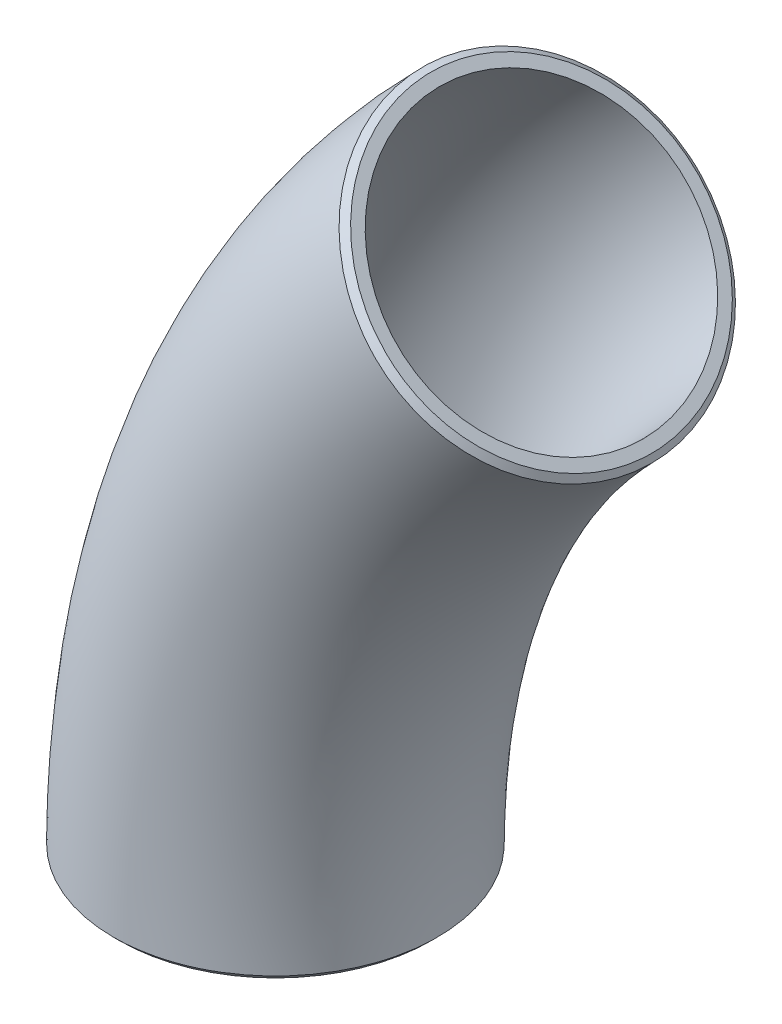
ISO-10303-21;
HEADER;
FILE_DESCRIPTION(('STEP AP214'),'2;1');
FILE_NAME('part.step','',(''),(''),'','','');
FILE_SCHEMA(('AUTOMOTIVE_DESIGN { 1 0 10303 214 1 1 1 1 }'));
ENDSEC;
DATA;
#1=APPLICATION_CONTEXT('core data for automotive mechanical design processes');
#2=APPLICATION_PROTOCOL_DEFINITION('international standard','automotive_design',2000,#1);
#3=PRODUCT_CONTEXT('',#1,'mechanical');
#4=PRODUCT('Part','Part','',(#3));
#5=PRODUCT_RELATED_PRODUCT_CATEGORY('part','',(#4));
#6=PRODUCT_DEFINITION_FORMATION('','',#4);
#7=PRODUCT_DEFINITION_CONTEXT('part definition',#1,'design');
#8=PRODUCT_DEFINITION('design','',#6,#7);
#9=PRODUCT_DEFINITION_SHAPE('','',#8);
#10=(LENGTH_UNIT() NAMED_UNIT(*) SI_UNIT(.MILLI.,.METRE.));
#11=(NAMED_UNIT(*) PLANE_ANGLE_UNIT() SI_UNIT($,.RADIAN.));
#12=(NAMED_UNIT(*) SI_UNIT($,.STERADIAN.) SOLID_ANGLE_UNIT());
#13=UNCERTAINTY_MEASURE_WITH_UNIT(LENGTH_MEASURE(1.E-05),#10,'distance_accuracy_value','');
#14=(GEOMETRIC_REPRESENTATION_CONTEXT(3) GLOBAL_UNCERTAINTY_ASSIGNED_CONTEXT((#13)) GLOBAL_UNIT_ASSIGNED_CONTEXT((#10,
#11,#12)) REPRESENTATION_CONTEXT('',''));
#15=CARTESIAN_POINT('',(0.,0.,0.));
#16=DIRECTION('',(0.,0.,1.));
#17=DIRECTION('',(1.,0.,0.));
#18=AXIS2_PLACEMENT_3D('',#15,#16,#17);
#19=CARTESIAN_POINT('',(0.,0.,0.));
#20=DIRECTION('',(0.,0.,1.));
#21=DIRECTION('',(1.,0.,0.));
#22=AXIS2_PLACEMENT_3D('',#19,#20,#21);
#23=TOROIDAL_SURFACE('',#22,766.445,136.525);
#24=CARTESIAN_POINT('',(-766.445631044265,5.0292041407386,136.524998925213));
#25=CARTESIAN_POINT('',(-767.792470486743,5.02952970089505,136.52521663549));
#26=CARTESIAN_POINT('',(-769.139222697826,5.02985353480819,136.504991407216));
#27=CARTESIAN_POINT('',(-771.836827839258,5.03049889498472,136.424140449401));
#28=CARTESIAN_POINT('',(-773.187676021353,5.03082040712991,136.363355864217));
#29=CARTESIAN_POINT('',(-777.243772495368,5.0317809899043,136.120726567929));
#30=CARTESIAN_POINT('',(-779.945618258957,5.03241442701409,135.878610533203));
#31=CARTESIAN_POINT('',(-785.325581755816,5.03366355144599,135.236501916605));
#32=CARTESIAN_POINT('',(-788.003733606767,5.03427926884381,134.836796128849));
#33=CARTESIAN_POINT('',(-791.992072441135,5.03518717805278,134.11738797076));
#34=CARTESIAN_POINT('',(-793.313424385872,5.03548647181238,133.858409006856));
#35=CARTESIAN_POINT('',(-795.945416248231,5.03607981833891,133.302351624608));
#36=CARTESIAN_POINT('',(-797.256071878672,5.03637388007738,133.005347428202));
#37=CARTESIAN_POINT('',(-801.171658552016,5.03724828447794,132.057263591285));
#38=CARTESIAN_POINT('',(-803.762919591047,5.03782146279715,131.348622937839));
#39=CARTESIAN_POINT('',(-808.902233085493,5.03894791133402,129.778172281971));
#40=CARTESIAN_POINT('',(-811.450221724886,5.03950115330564,128.916154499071));
#41=CARTESIAN_POINT('',(-816.502938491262,5.04058862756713,127.03922240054));
#42=CARTESIAN_POINT('',(-819.007411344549,5.04112275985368,126.023617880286));
#43=CARTESIAN_POINT('',(-822.722062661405,5.04190819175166,124.38663619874));
#44=CARTESIAN_POINT('',(-823.956743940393,5.04216809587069,123.820260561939));
#45=CARTESIAN_POINT('',(-826.408364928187,5.04268199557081,122.651491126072));
#46=CARTESIAN_POINT('',(-827.625310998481,5.04293599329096,122.049110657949));
#47=CARTESIAN_POINT('',(-831.234599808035,5.04368614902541,120.194567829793));
#48=CARTESIAN_POINT('',(-833.59971902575,5.04417349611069,118.888695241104));
#49=CARTESIAN_POINT('',(-837.081872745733,5.04488540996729,116.829762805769));
#50=CARTESIAN_POINT('',(-838.229696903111,5.04511913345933,116.128093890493));
#51=CARTESIAN_POINT('',(-840.501443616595,5.04557990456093,114.692377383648));
#52=CARTESIAN_POINT('',(-841.625412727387,5.04580696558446,113.958403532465));
#53=CARTESIAN_POINT('',(-844.964034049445,5.04647888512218,111.70760007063));
#54=CARTESIAN_POINT('',(-847.14583525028,5.04691456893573,110.141631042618));
#55=CARTESIAN_POINT('',(-851.419764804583,5.04776200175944,106.879035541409));
#56=CARTESIAN_POINT('',(-853.511601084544,5.04817367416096,105.182027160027));
#57=CARTESIAN_POINT('',(-857.602117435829,5.04897327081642,101.657194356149));
#58=CARTESIAN_POINT('',(-859.600222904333,5.04936105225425,99.8287027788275));
#59=CARTESIAN_POINT('',(-863.489999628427,5.05011121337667,96.0513041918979));
#60=CARTESIAN_POINT('',(-865.381358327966,5.05047351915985,94.1020754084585));
#61=CARTESIAN_POINT('',(-869.031799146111,5.05116868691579,90.1081270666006));
#62=CARTESIAN_POINT('',(-870.791705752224,5.05150173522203,88.0641613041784));
#63=CARTESIAN_POINT('',(-874.179721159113,5.05213935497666,83.8837300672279));
#64=CARTESIAN_POINT('',(-875.808342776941,5.05244403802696,81.74768009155));
#65=CARTESIAN_POINT('',(-878.937119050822,5.05302651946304,77.385091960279));
#66=CARTESIAN_POINT('',(-880.437335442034,5.05330433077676,75.1585980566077));
#67=CARTESIAN_POINT('',(-883.309570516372,5.0538338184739,70.6099404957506));
#68=CARTESIAN_POINT('',(-884.680972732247,5.05408536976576,68.2873865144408));
#69=CARTESIAN_POINT('',(-886.636744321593,5.05444267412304,64.740798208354));
#70=CARTESIAN_POINT('',(-887.273192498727,5.05455869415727,63.5451797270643));
#71=CARTESIAN_POINT('',(-888.511635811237,5.0547840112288,61.1323386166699));
#72=CARTESIAN_POINT('',(-889.113539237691,5.0548932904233,59.9150687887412));
#73=CARTESIAN_POINT('',(-890.280711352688,5.05510480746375,57.4638896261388));
#74=CARTESIAN_POINT('',(-890.845999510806,5.05520704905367,56.2299895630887));
#75=CARTESIAN_POINT('',(-891.937102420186,5.05540404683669,53.7503035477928));
#76=CARTESIAN_POINT('',(-892.463054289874,5.05549882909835,52.5045777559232));
#77=CARTESIAN_POINT('',(-893.980668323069,5.05577190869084,48.7563979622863));
#78=CARTESIAN_POINT('',(-894.917534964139,5.05593992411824,46.2314824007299));
#79=CARTESIAN_POINT('',(-896.638005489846,5.05624766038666,41.1373454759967));
#80=CARTESIAN_POINT('',(-897.421993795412,5.05638745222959,38.5682533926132));
#81=CARTESIAN_POINT('',(-898.837496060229,5.05663929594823,33.3859000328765));
#82=CARTESIAN_POINT('',(-899.468882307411,5.05675132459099,30.7726037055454));
#83=CARTESIAN_POINT('',(-900.301284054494,5.05689882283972,26.8244957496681));
#84=CARTESIAN_POINT('',(-900.559965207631,5.05694462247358,25.5015912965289));
#85=CARTESIAN_POINT('',(-901.038501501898,5.05702928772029,22.8432903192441));
#86=CARTESIAN_POINT('',(-901.25819656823,5.05706812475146,21.5078649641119));
#87=CARTESIAN_POINT('',(-901.858979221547,5.05717426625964,17.4837594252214));
#88=CARTESIAN_POINT('',(-902.179950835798,5.05723088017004,14.7858570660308));
#89=CARTESIAN_POINT('',(-902.659320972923,5.05731539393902,9.39009814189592));
#90=CARTESIAN_POINT('',(-902.818564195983,5.0573434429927,6.69231570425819));
#91=CARTESIAN_POINT('',(-902.97620425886,5.0573712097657,1.30538047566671));
#92=CARTESIAN_POINT('',(-902.975393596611,5.05737106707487,-1.3837489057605));
#93=CARTESIAN_POINT('',(-902.815129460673,5.05734283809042,-6.75401390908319));
#94=CARTESIAN_POINT('',(-902.655867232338,5.05731478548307,-9.43515525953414));
#95=CARTESIAN_POINT('',(-902.179184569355,5.05723074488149,-14.7885778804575));
#96=CARTESIAN_POINT('',(-901.86145869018,5.0571747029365,-17.4608319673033));
#97=CARTESIAN_POINT('',(-901.066105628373,5.05703419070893,-22.7984170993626));
#98=CARTESIAN_POINT('',(-900.587497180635,5.05694954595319,-25.4636019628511));
#99=CARTESIAN_POINT('',(-899.47122394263,5.05675172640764,-30.7680597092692));
#100=CARTESIAN_POINT('',(-898.833128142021,5.05663847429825,-33.4072418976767));
#101=CARTESIAN_POINT('',(-897.405402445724,5.05638442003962,-38.6258733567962));
#102=CARTESIAN_POINT('',(-896.616783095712,5.05624380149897,-41.2055991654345));
#103=CARTESIAN_POINT('',(-894.891412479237,5.05593520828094,-46.3046518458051));
#104=CARTESIAN_POINT('',(-893.955206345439,5.05576733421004,-48.8241631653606));
#105=CARTESIAN_POINT('',(-891.935799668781,5.05540395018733,-53.802866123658));
#106=CARTESIAN_POINT('',(-890.852634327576,5.0552084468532,-56.2620720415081));
#107=CARTESIAN_POINT('',(-888.540130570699,5.05478937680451,-61.1192524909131));
#108=CARTESIAN_POINT('',(-887.310390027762,5.05456573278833,-63.517035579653));
#109=CARTESIAN_POINT('',(-884.701758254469,5.05408917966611,-68.2522555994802));
#110=CARTESIAN_POINT('',(-883.321870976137,5.0538360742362,-70.5891438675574));
#111=CARTESIAN_POINT('',(-880.427338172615,5.05330248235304,-75.1737834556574));
#112=CARTESIAN_POINT('',(-878.912865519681,5.05302203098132,-77.4216439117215));
#113=CARTESIAN_POINT('',(-875.763007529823,5.0524355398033,-81.8090335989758));
#114=CARTESIAN_POINT('',(-874.128463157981,5.05212967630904,-83.9491669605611));
#115=CARTESIAN_POINT('',(-870.73959629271,5.05149180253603,-88.1240925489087));
#116=CARTESIAN_POINT('',(-868.985571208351,5.05115985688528,-90.1591256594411));
#117=CARTESIAN_POINT('',(-866.267084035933,5.05064214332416,-93.1311988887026));
#118=CARTESIAN_POINT('',(-865.346300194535,5.05046626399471,-94.1085224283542));
#119=CARTESIAN_POINT('',(-863.475731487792,5.0501078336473,-96.036576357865));
#120=CARTESIAN_POINT('',(-862.525923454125,5.04992527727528,-96.9872842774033));
#121=CARTESIAN_POINT('',(-859.627108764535,5.04936626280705,-99.8039042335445));
#122=CARTESIAN_POINT('',(-857.635780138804,5.04897980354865,-101.626575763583));
#123=CARTESIAN_POINT('',(-853.535268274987,5.04817832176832,-105.162480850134));
#124=CARTESIAN_POINT('',(-851.425394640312,5.04776312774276,-106.874913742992));
#125=CARTESIAN_POINT('',(-848.190143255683,5.04712164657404,-109.344738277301));
#126=CARTESIAN_POINT('',(-847.101442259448,5.04690499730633,-110.150561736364));
#127=CARTESIAN_POINT('',(-844.904320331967,5.04646609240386,-111.726430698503));
#128=CARTESIAN_POINT('',(-843.79598439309,5.04624385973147,-112.496594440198));
#129=CARTESIAN_POINT('',(-841.560590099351,5.04579388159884,-114.001031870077));
#130=CARTESIAN_POINT('',(-840.433606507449,5.04556615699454,-114.735416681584));
#131=CARTESIAN_POINT('',(-838.160420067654,5.04510501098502,-116.169819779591));
#132=CARTESIAN_POINT('',(-837.014249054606,5.04487159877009,-116.869888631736));
#133=CARTESIAN_POINT('',(-833.546765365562,5.04416259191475,-118.918131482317));
#134=CARTESIAN_POINT('',(-831.195048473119,5.04367793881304,-120.215306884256));
#135=CARTESIAN_POINT('',(-826.413762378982,5.04268413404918,-122.670900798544));
#136=CARTESIAN_POINT('',(-823.98403355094,5.04217493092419,-123.829008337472));
#137=CARTESIAN_POINT('',(-820.287147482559,5.04139335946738,-125.459919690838));
#138=CARTESIAN_POINT('',(-819.0436079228,5.04112933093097,-125.986790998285));
#139=CARTESIAN_POINT('',(-816.5361519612,5.04059453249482,-127.005113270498));
#140=CARTESIAN_POINT('',(-815.272172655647,5.04032373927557,-127.496409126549));
#141=CARTESIAN_POINT('',(-811.457337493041,5.03950273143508,-128.914324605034));
#142=CARTESIAN_POINT('',(-808.885060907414,5.03894420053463,-129.78432114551));
#143=CARTESIAN_POINT('',(-804.997527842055,5.03809204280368,-130.970936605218));
#144=CARTESIAN_POINT('',(-803.699750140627,5.03780624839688,-131.346041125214));
#145=CARTESIAN_POINT('',(-801.097038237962,5.03723038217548,-132.056906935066));
#146=CARTESIAN_POINT('',(-799.792131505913,5.03694032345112,-132.392768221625));
#147=CARTESIAN_POINT('',(-797.176153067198,5.03635604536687,-133.024793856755));
#148=CARTESIAN_POINT('',(-795.86510457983,5.036061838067,-133.321054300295));
#149=CARTESIAN_POINT('',(-793.237311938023,5.03546927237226,-133.873891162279));
#150=CARTESIAN_POINT('',(-791.920583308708,5.03517092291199,-134.130541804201));
#151=CARTESIAN_POINT('',(-787.958305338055,5.03426878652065,-134.842956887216));
#152=CARTESIAN_POINT('',(-785.302091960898,5.0336582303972,-135.240840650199));
#153=CARTESIAN_POINT('',(-779.961645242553,5.03241841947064,-135.87997910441));
#154=CARTESIAN_POINT('',(-777.277346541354,5.03178910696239,-136.120683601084));
#155=CARTESIAN_POINT('',(-771.881779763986,5.03051129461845,-136.44333145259));
#156=CARTESIAN_POINT('',(-769.170449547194,5.029862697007,-136.524237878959));
#157=CARTESIAN_POINT('',(-763.74394436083,5.02855117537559,-136.525756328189));
#158=CARTESIAN_POINT('',(-761.02876934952,5.0278882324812,-136.446142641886));
#159=CARTESIAN_POINT('',(-755.615560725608,5.02655273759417,-136.12505563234));
#160=CARTESIAN_POINT('',(-752.917500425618,5.0258802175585,-135.884034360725));
#161=CARTESIAN_POINT('',(-747.536606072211,5.02452496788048,-135.240355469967));
#162=CARTESIAN_POINT('',(-744.85380136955,5.02384222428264,-134.837452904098));
#163=CARTESIAN_POINT('',(-739.511065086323,5.02246837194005,-133.87271611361));
#164=CARTESIAN_POINT('',(-736.851193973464,5.02177724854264,-133.310547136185));
#165=CARTESIAN_POINT('',(-731.585005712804,5.02039462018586,-132.032025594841));
#166=CARTESIAN_POINT('',(-728.978468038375,5.01970314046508,-131.316581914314));
#167=CARTESIAN_POINT('',(-723.824082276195,5.01832176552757,-129.735470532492));
#168=CARTESIAN_POINT('',(-721.276024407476,5.01763187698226,-128.870486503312));
#169=CARTESIAN_POINT('',(-716.240642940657,5.01625478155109,-126.994176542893));
#170=CARTESIAN_POINT('',(-713.753200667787,5.01556757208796,-125.983168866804));
#171=CARTESIAN_POINT('',(-708.835682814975,5.01419542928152,-123.812609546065));
#172=CARTESIAN_POINT('',(-706.405782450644,5.01351050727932,-122.65265977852));
#173=CARTESIAN_POINT('',(-702.811633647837,5.01248760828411,-120.80537208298));
#174=CARTESIAN_POINT('',(-701.620103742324,5.01214682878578,-120.170575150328));
#175=CARTESIAN_POINT('',(-699.25090492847,5.01146591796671,-118.862469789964));
#176=CARTESIAN_POINT('',(-698.073330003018,5.01112579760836,-118.188991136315));
#177=CARTESIAN_POINT('',(-694.570578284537,5.01010926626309,-116.116220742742));
#178=CARTESIAN_POINT('',(-692.275915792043,5.00943683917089,-114.664872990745));
#179=CARTESIAN_POINT('',(-687.792087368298,5.00811064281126,-111.637576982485));
#180=CARTESIAN_POINT('',(-685.602335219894,5.00745678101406,-110.062495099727));
#181=CARTESIAN_POINT('',(-681.327576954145,5.00616899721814,-106.791537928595));
#182=CARTESIAN_POINT('',(-679.242219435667,5.00553501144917,-105.096121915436));
#183=CARTESIAN_POINT('',(-675.176007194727,5.00428826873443,-101.585120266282));
#184=CARTESIAN_POINT('',(-673.195125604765,5.00367550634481,-99.7695657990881));
#185=CARTESIAN_POINT('',(-670.304444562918,5.00277414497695,-96.960849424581));
#186=CARTESIAN_POINT('',(-669.353597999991,5.00247642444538,-96.0095866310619));
#187=CARTESIAN_POINT('',(-667.477354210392,5.00188655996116,-94.074855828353));
#188=CARTESIAN_POINT('',(-666.552074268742,5.00159444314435,-93.0912740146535));
#189=CARTESIAN_POINT('',(-663.814001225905,5.00072666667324,-90.0928031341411));
#190=CARTESIAN_POINT('',(-662.045853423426,5.00016172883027,-88.0368771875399));
#191=CARTESIAN_POINT('',(-658.634331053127,4.99906397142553,-83.8258810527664));
#192=CARTESIAN_POINT('',(-656.990886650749,4.99853113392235,-81.6708674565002));
#193=CARTESIAN_POINT('',(-654.628487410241,4.99776002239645,-78.3725226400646));
#194=CARTESIAN_POINT('',(-653.85972917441,4.99750819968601,-77.2646145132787));
#195=CARTESIAN_POINT('',(-652.35833592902,4.99701476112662,-75.0298785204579));
#196=CARTESIAN_POINT('',(-651.625590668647,4.99677311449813,-73.9031246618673));
#197=CARTESIAN_POINT('',(-649.478434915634,4.99606286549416,-70.4936183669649));
#198=CARTESIAN_POINT('',(-648.113515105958,4.9956084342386,-68.1793962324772));
#199=CARTESIAN_POINT('',(-645.522501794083,4.99474103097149,-63.4725282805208));
#200=CARTESIAN_POINT('',(-644.296510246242,4.99432808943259,-61.079826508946));
#201=CARTESIAN_POINT('',(-641.982497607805,4.99354488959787,-56.2161106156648));
#202=CARTESIAN_POINT('',(-640.895073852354,4.99317481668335,-53.7448112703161));
#203=CARTESIAN_POINT('',(-639.373040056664,4.99265464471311,-49.9858323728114));
#204=CARTESIAN_POINT('',(-638.882633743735,4.99248664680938,-48.7204717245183));
#205=CARTESIAN_POINT('',(-637.938979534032,4.99216272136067,-46.1742063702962));
#206=CARTESIAN_POINT('',(-637.48577678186,4.99200680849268,-44.893284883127));
#207=CARTESIAN_POINT('',(-636.619072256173,4.99170807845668,-42.3224882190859));
#208=CARTESIAN_POINT('',(-636.205451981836,4.99156522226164,-41.0326530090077));
#209=CARTESIAN_POINT('',(-635.418714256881,4.99129304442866,-38.4467055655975));
#210=CARTESIAN_POINT('',(-635.045432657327,4.99116366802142,-37.1506430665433));
#211=CARTESIAN_POINT('',(-633.985173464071,4.99079562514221,-33.2542401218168));
#212=CARTESIAN_POINT('',(-633.355233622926,4.99057616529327,-30.6381104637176));
#213=CARTESIAN_POINT('',(-632.252819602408,4.9901913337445,-25.3784300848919));
#214=CARTESIAN_POINT('',(-631.780038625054,4.99002585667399,-22.7349433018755));
#215=CARTESIAN_POINT('',(-630.989380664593,4.98974875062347,-17.4172424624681));
#216=CARTESIAN_POINT('',(-630.671944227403,4.98963727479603,-14.7429627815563));
#217=CARTESIAN_POINT('',(-630.195014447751,4.98946954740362,-9.36821333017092));
#218=CARTESIAN_POINT('',(-630.036239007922,4.98941354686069,-6.66767984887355));
#219=CARTESIAN_POINT('',(-629.878912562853,4.9893580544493,-1.25145532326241));
#220=CARTESIAN_POINT('',(-629.880985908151,4.98935878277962,1.46425386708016));
#221=CARTESIAN_POINT('',(-630.046598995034,4.98941709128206,6.87302635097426));
#222=CARTESIAN_POINT('',(-630.209086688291,4.98947430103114,9.5661219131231));
#223=CARTESIAN_POINT('',(-630.692216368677,4.98964417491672,14.9277953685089));
#224=CARTESIAN_POINT('',(-631.012256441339,4.98975662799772,17.596427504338));
#225=CARTESIAN_POINT('',(-631.80915923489,4.99003600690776,22.9087490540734));
#226=CARTESIAN_POINT('',(-632.285940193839,4.99020290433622,25.5524507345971));
#227=CARTESIAN_POINT('',(-633.396100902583,4.99059042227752,30.8146657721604));
#228=CARTESIAN_POINT('',(-634.029923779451,4.99081119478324,33.4330856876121));
#229=CARTESIAN_POINT('',(-635.455942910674,4.99130613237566,38.6446136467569));
#230=CARTESIAN_POINT('',(-636.24913796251,4.99158063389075,41.2374480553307));
#231=CARTESIAN_POINT('',(-637.988543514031,4.99218003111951,46.3727768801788));
#232=CARTESIAN_POINT('',(-638.934822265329,4.99250494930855,48.915248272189));
#233=CARTESIAN_POINT('',(-640.464510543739,4.99302762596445,52.6756090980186));
#234=CARTESIAN_POINT('',(-640.99119258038,4.99320719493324,53.9168432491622));
#235=CARTESIAN_POINT('',(-642.079432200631,4.99357730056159,56.3804301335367));
#236=CARTESIAN_POINT('',(-642.640904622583,4.99376781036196,57.6028204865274));
#237=CARTESIAN_POINT('',(-644.377097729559,4.99435532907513,61.2399956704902));
#238=CARTESIAN_POINT('',(-645.605479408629,4.99476897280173,63.6294188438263));
#239=CARTESIAN_POINT('',(-648.20203253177,4.99563799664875,68.332413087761));
#240=CARTESIAN_POINT('',(-649.570265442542,4.99609339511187,70.6459502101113));
#241=CARTESIAN_POINT('',(-651.723928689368,4.99680557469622,74.0557713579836));
#242=CARTESIAN_POINT('',(-652.459696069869,4.99704813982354,75.1836843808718));
#243=CARTESIAN_POINT('',(-653.967454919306,4.99754352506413,77.4214539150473));
#244=CARTESIAN_POINT('',(-654.739576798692,4.99779638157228,78.5312225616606));
#245=CARTESIAN_POINT('',(-657.111207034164,4.99857030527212,81.8339537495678));
#246=CARTESIAN_POINT('',(-658.760416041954,4.99910488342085,83.9915284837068));
#247=CARTESIAN_POINT('',(-662.178227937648,5.00020426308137,88.1973078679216));
#248=CARTESIAN_POINT('',(-663.946397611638,5.00076895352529,90.2458653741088));
#249=CARTESIAN_POINT('',(-667.590787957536,5.00192341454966,94.2225715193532));
#250=CARTESIAN_POINT('',(-669.466316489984,5.00251301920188,96.1513540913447));
#251=CARTESIAN_POINT('',(-673.324711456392,5.00371573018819,99.8917171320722));
#252=CARTESIAN_POINT('',(-675.307393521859,5.00432879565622,101.703487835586));
#253=CARTESIAN_POINT('',(-679.378819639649,5.0055766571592,105.209422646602));
#254=CARTESIAN_POINT('',(-681.467703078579,5.0062114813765,106.903424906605));
#255=CARTESIAN_POINT('',(-685.753904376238,5.00750218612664,110.17408601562));
#256=CARTESIAN_POINT('',(-687.951762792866,5.00815816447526,111.750036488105));
#257=CARTESIAN_POINT('',(-692.447356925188,5.00948723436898,114.775700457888));
#258=CARTESIAN_POINT('',(-694.745503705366,5.01016039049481,116.224803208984));
#259=CARTESIAN_POINT('',(-699.409979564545,5.01151335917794,118.975021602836));
#260=CARTESIAN_POINT('',(-701.77581219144,5.01219310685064,120.276979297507));
#261=CARTESIAN_POINT('',(-706.570041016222,5.01355695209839,122.733008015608));
#262=CARTESIAN_POINT('',(-708.998120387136,5.01424101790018,123.88769755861));
#263=CARTESIAN_POINT('',(-713.915861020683,5.01561263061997,126.050767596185));
#264=CARTESIAN_POINT('',(-716.4054617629,5.01630017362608,127.059285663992));
#265=CARTESIAN_POINT('',(-721.446534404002,5.017678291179,128.930339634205));
#266=CARTESIAN_POINT('',(-723.998155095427,5.01836886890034,129.792474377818));
#267=CARTESIAN_POINT('',(-729.16512451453,5.01975292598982,131.369257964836));
#268=CARTESIAN_POINT('',(-731.780782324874,5.02044639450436,132.082897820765));
#269=CARTESIAN_POINT('',(-735.735060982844,5.02148401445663,133.036917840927));
#270=CARTESIAN_POINT('',(-737.059825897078,5.02182985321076,133.335794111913));
#271=CARTESIAN_POINT('',(-739.713464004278,5.0225189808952,133.892713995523));
#272=CARTESIAN_POINT('',(-741.042310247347,5.02286227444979,134.150885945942));
#273=CARTESIAN_POINT('',(-745.026507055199,5.02388624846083,134.863831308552));
#274=CARTESIAN_POINT('',(-747.692537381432,5.02456443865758,135.260167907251));
#275=CARTESIAN_POINT('',(-753.035300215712,5.02590959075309,135.893058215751));
#276=CARTESIAN_POINT('',(-755.711975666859,5.02657658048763,136.130093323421));
#277=CARTESIAN_POINT('',(-759.733409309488,5.02756851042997,136.366846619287));
#278=CARTESIAN_POINT('',(-761.074896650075,5.02789771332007,136.425964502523));
#279=CARTESIAN_POINT('',(-763.7594436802,5.02855319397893,136.504904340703));
#280=CARTESIAN_POINT('',(-765.102503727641,5.02887947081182,136.52471414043));
#281=CARTESIAN_POINT('',(-766.445631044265,5.0292041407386,136.524998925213));
#282=B_SPLINE_CURVE_WITH_KNOTS('',3,(#24,#25,#26,#27,#28,#29,#30,#31,#32,#33,#34,#35,#36,#37,
#38,#39,#40,#41,#42,#43,#44,#45,#46,#47,#48,#49,#50,#51,#52,#53,#54,#55,#56,#57,#58,#59,#60,#61,
#62,#63,#64,#65,#66,#67,#68,#69,#70,#71,#72,#73,#74,#75,#76,#77,#78,#79,#80,#81,#82,#83,#84,#85,
#86,#87,#88,#89,#90,#91,#92,#93,#94,#95,#96,#97,#98,#99,#100,#101,#102,#103,#104,#105,#106,#107,
#108,#109,#110,#111,#112,#113,#114,#115,#116,#117,#118,#119,#120,#121,#122,#123,#124,#125,#126,
#127,#128,#129,#130,#131,#132,#133,#134,#135,#136,#137,#138,#139,#140,#141,#142,#143,#144,#145,
#146,#147,#148,#149,#150,#151,#152,#153,#154,#155,#156,#157,#158,#159,#160,#161,#162,#163,#164,
#165,#166,#167,#168,#169,#170,#171,#172,#173,#174,#175,#176,#177,#178,#179,#180,#181,#182,#183,
#184,#185,#186,#187,#188,#189,#190,#191,#192,#193,#194,#195,#196,#197,#198,#199,#200,#201,#202,
#203,#204,#205,#206,#207,#208,#209,#210,#211,#212,#213,#214,#215,#216,#217,#218,#219,#220,#221,
#222,#223,#224,#225,#226,#227,#228,#229,#230,#231,#232,#233,#234,#235,#236,#237,#238,#239,#240,
#241,#242,#243,#244,#245,#246,#247,#248,#249,#250,#251,#252,#253,#254,#255,#256,#257,#258,#259,
#260,#261,#262,#263,#264,#265,#266,#267,#268,#269,#270,#271,#272,#273,#274,#275,#276,#277,#278,
#279,#280,#281),.UNSPECIFIED.,.F.,.F.,(4,2,2,2,2,2,2,2,2,2,2,2,2,2,2,2,2,2,2,2,2,2,2,2,2,2,2,2,
2,2,2,2,2,2,2,2,2,2,2,2,2,2,2,2,2,2,2,2,2,2,2,2,2,2,2,2,2,2,2,2,2,2,2,2,2,2,2,2,2,2,2,2,2,2,2,2,
2,2,2,2,2,2,2,2,2,2,2,2,2,2,2,2,2,2,2,2,2,2,2,2,2,2,2,2,2,2,2,2,2,2,2,2,2,2,2,2,2,2,2,2,2,2,2,2,
2,2,2,2,4),(0.,4.04019337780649,8.09630427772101,16.229355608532,24.3476735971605,
28.386614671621,32.4177889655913,40.4718879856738,48.5369821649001,56.6394607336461,
60.7140981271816,64.7872361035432,72.8866242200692,76.9220662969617,80.948731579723,
89.0005480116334,97.0767875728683,105.19737452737,113.340621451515,121.4275398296,
129.481161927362,137.530889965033,145.617363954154,149.680265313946,153.753496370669,
157.824543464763,161.880665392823,169.954906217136,178.008574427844,186.068959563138,
190.112325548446,194.171927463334,202.317477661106,210.420261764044,218.482926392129,
226.535871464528,234.604399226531,242.723060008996,250.863903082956,258.951901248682,
267.010696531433,275.067564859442,283.147069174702,291.283880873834,299.4103880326,
307.484590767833,315.539382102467,319.567166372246,323.59825439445,331.691818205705,
339.838737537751,343.901680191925,347.950012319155,351.984843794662,356.013539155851,
364.065753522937,372.135650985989,376.186766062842,380.254595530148,388.395088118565,
392.447341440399,396.489032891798,400.520731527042,404.544781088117,412.597280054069,
420.677817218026,428.810618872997,436.954864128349,445.076394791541,453.210260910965,
461.361351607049,469.465383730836,477.533300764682,485.583892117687,493.656469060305,
497.706190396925,501.775349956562,509.915492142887,518.002998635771,526.061145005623,
534.117208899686,538.151684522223,542.202331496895,550.332361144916,558.457803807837,
562.50275402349,566.5344319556,574.589597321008,582.650636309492,590.745326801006,
594.816035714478,598.891613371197,602.954580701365,607.000337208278,615.067914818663,
623.11964951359,631.194087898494,639.304897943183,647.447192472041,655.536439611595,
663.595019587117,671.649402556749,679.726776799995,687.856446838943,695.989751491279,
700.034301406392,704.06931463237,712.12435596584,720.182952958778,724.222472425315,
728.277789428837,736.41964028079,744.533297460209,752.599519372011,760.652278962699,
768.715895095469,776.824556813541,784.970328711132,793.066833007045,801.12812647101,
809.181782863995,817.257165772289,825.385745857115,829.459408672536,833.519958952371,
841.600943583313,849.657396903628,853.68526043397,857.71436930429),.UNSPECIFIED.);
#283=CARTESIAN_POINT('',(-766.445631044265,5.0292041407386,136.524998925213));
#284=VERTEX_POINT('',#283);
#285=EDGE_CURVE('E51',#284,#284,#282,.F.);
#286=ORIENTED_EDGE('',*,*,#285,.T.);
#287=EDGE_LOOP('',(#286));
#288=FACE_BOUND('',#287,.T.);
#289=CARTESIAN_POINT('',(-545.515087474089,538.402718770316,136.524998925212));
#290=CARTESIAN_POINT('',(-542.366095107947,535.255248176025,136.526215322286));
#291=CARTESIAN_POINT('',(-539.206879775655,532.097585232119,136.309050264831));
#292=CARTESIAN_POINT('',(-532.859956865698,525.753835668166,135.424835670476));
#293=CARTESIAN_POINT('',(-529.718838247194,522.614314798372,134.763772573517));
#294=CARTESIAN_POINT('',(-520.446406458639,513.34668120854,132.146960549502));
#295=CARTESIAN_POINT('',(-514.42737424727,507.330872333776,129.570784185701));
#296=CARTESIAN_POINT('',(-505.641441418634,498.549802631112,124.431902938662));
#297=CARTESIAN_POINT('',(-502.746864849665,495.656855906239,122.495487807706));
#298=CARTESIAN_POINT('',(-497.164711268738,490.077896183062,118.272821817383));
#299=CARTESIAN_POINT('',(-494.456839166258,487.371599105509,115.976799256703));
#300=CARTESIAN_POINT('',(-486.620247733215,479.539635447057,108.56915384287));
#301=CARTESIAN_POINT('',(-481.729468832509,474.651839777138,102.913008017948));
#302=CARTESIAN_POINT('',(-472.708037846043,465.636055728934,90.158544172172));
#303=CARTESIAN_POINT('',(-468.716250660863,461.646843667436,83.2597545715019));
#304=CARTESIAN_POINT('',(-463.474639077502,456.408677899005,72.180658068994));
#305=CARTESIAN_POINT('',(-461.849690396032,454.784810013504,68.3514722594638));
#306=CARTESIAN_POINT('',(-458.856672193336,451.79379976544,60.4434744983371));
#307=CARTESIAN_POINT('',(-457.488082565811,450.426137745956,56.3536666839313));
#308=CARTESIAN_POINT('',(-453.859655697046,446.800187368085,43.9545222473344));
#309=CARTESIAN_POINT('',(-452.034517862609,444.97631889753,35.4434564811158));
#310=CARTESIAN_POINT('',(-450.180900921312,443.123996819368,22.3195449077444));
#311=CARTESIAN_POINT('',(-449.712073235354,442.655498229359,17.8647444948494));
#312=CARTESIAN_POINT('',(-449.087762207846,442.031625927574,8.90284498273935));
#313=CARTESIAN_POINT('',(-448.934589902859,441.878561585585,4.44510394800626));
#314=CARTESIAN_POINT('',(-448.934901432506,441.878872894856,-4.45883781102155));
#315=CARTESIAN_POINT('',(-449.088732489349,442.032595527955,-8.89934044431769));
#316=CARTESIAN_POINT('',(-449.703397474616,442.646828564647,-17.757435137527));
#317=CARTESIAN_POINT('',(-450.163756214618,443.106864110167,-22.170681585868));
#318=CARTESIAN_POINT('',(-451.401892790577,444.344135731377,-30.9910106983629));
#319=CARTESIAN_POINT('',(-452.178535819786,445.120237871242,-35.3708802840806));
#320=CARTESIAN_POINT('',(-454.01224477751,446.952678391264,-43.9117841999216));
#321=CARTESIAN_POINT('',(-455.073684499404,448.013387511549,-48.1052488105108));
#322=CARTESIAN_POINT('',(-457.479102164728,450.41716352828,-56.3208685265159));
#323=CARTESIAN_POINT('',(-458.825102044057,451.76225100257,-60.3495698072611));
#324=CARTESIAN_POINT('',(-461.798562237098,454.733715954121,-68.2265884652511));
#325=CARTESIAN_POINT('',(-463.441244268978,456.375305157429,-72.106316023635));
#326=CARTESIAN_POINT('',(-466.971596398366,459.903336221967,-79.5758132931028));
#327=CARTESIAN_POINT('',(-468.851849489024,461.78236580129,-83.1576468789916));
#328=CARTESIAN_POINT('',(-472.844454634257,465.772406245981,-90.0371657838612));
#329=CARTESIAN_POINT('',(-474.957126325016,467.883736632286,-93.3339126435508));
#330=CARTESIAN_POINT('',(-479.405858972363,472.329684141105,-99.63222423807));
#331=CARTESIAN_POINT('',(-481.745482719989,474.667862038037,-102.635852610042));
#332=CARTESIAN_POINT('',(-486.670842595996,479.59022426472,-108.355880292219));
#333=CARTESIAN_POINT('',(-489.226084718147,482.143933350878,-111.035159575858));
#334=CARTESIAN_POINT('',(-497.094066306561,490.007269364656,-118.464063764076));
#335=CARTESIAN_POINT('',(-502.638840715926,495.548865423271,-122.662460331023));
#336=CARTESIAN_POINT('',(-511.410557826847,504.315725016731,-127.812726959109));
#337=CARTESIAN_POINT('',(-514.424678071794,507.328203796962,-129.33918033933));
#338=CARTESIAN_POINT('',(-520.489340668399,513.389620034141,-131.940666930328));
#339=CARTESIAN_POINT('',(-523.552630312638,516.451297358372,-133.026190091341));
#340=CARTESIAN_POINT('',(-532.798101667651,525.691985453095,-135.627557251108));
#341=CARTESIAN_POINT('',(-539.07647708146,531.967220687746,-136.520544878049));
#342=CARTESIAN_POINT('',(-551.834558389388,544.71913495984,-136.529422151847));
#343=CARTESIAN_POINT('',(-558.139812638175,551.021445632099,-135.651011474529));
#344=CARTESIAN_POINT('',(-570.65268892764,563.528660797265,-132.121466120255));
#345=CARTESIAN_POINT('',(-576.703985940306,569.57731131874,-129.505481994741));
#346=CARTESIAN_POINT('',(-585.410858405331,578.280478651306,-124.399530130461));
#347=CARTESIAN_POINT('',(-588.263286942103,581.13171145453,-122.489991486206));
#348=CARTESIAN_POINT('',(-593.838425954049,586.704544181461,-118.274327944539));
#349=CARTESIAN_POINT('',(-596.587076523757,589.452073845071,-115.942277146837));
#350=CARTESIAN_POINT('',(-601.853528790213,594.716404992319,-110.956192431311));
#351=CARTESIAN_POINT('',(-604.385157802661,597.2470278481,-108.295510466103));
#352=CARTESIAN_POINT('',(-609.245365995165,602.105325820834,-102.647414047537));
#353=CARTESIAN_POINT('',(-611.576022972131,604.435077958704,-99.6559336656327));
#354=CARTESIAN_POINT('',(-618.255873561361,611.112360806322,-90.2112919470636));
#355=CARTESIAN_POINT('',(-622.340061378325,615.195015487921,-83.1668998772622));
#356=CARTESIAN_POINT('',(-627.580737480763,620.433751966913,-72.0497170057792));
#357=CARTESIAN_POINT('',(-629.197946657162,622.05036775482,-68.2315153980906));
#358=CARTESIAN_POINT('',(-632.161099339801,625.012440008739,-60.3854535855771));
#359=CARTESIAN_POINT('',(-633.509482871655,626.360335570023,-56.3535151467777));
#360=CARTESIAN_POINT('',(-635.932994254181,628.782974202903,-48.0776818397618));
#361=CARTESIAN_POINT('',(-637.011401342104,629.86099536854,-43.8082918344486));
#362=CARTESIAN_POINT('',(-638.841808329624,631.690749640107,-35.2486362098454));
#363=CARTESIAN_POINT('',(-639.60654574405,632.455215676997,-30.9186248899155));
#364=CARTESIAN_POINT('',(-641.438993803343,634.287014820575,-17.8454509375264));
#365=CARTESIAN_POINT('',(-642.065774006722,634.913574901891,-8.93922209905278));
#366=CARTESIAN_POINT('',(-642.060534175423,634.908336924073,4.57888875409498));
#367=CARTESIAN_POINT('',(-641.901839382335,634.749697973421,9.0404603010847));
#368=CARTESIAN_POINT('',(-641.280206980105,634.128284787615,17.9041603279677));
#369=CARTESIAN_POINT('',(-640.817281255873,633.66552242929,22.3017393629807));
#370=CARTESIAN_POINT('',(-639.588135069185,632.436811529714,31.0285638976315));
#371=CARTESIAN_POINT('',(-638.822210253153,631.671158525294,35.3554166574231));
#372=CARTESIAN_POINT('',(-636.978049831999,629.827655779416,43.9485949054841));
#373=CARTESIAN_POINT('',(-635.899729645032,628.749721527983,48.2035703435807));
#374=CARTESIAN_POINT('',(-632.263060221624,625.11436187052,60.5848814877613));
#375=CARTESIAN_POINT('',(-629.29520710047,622.147586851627,68.4268494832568));
#376=CARTESIAN_POINT('',(-624.035158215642,616.889485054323,79.563775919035));
#377=CARTESIAN_POINT('',(-622.134313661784,614.989349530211,83.1868014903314));
#378=CARTESIAN_POINT('',(-618.095586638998,610.952144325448,90.1374645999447));
#379=CARTESIAN_POINT('',(-615.974411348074,608.831775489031,93.4401138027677));
#380=CARTESIAN_POINT('',(-611.520641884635,604.379718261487,99.7311481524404));
#381=CARTESIAN_POINT('',(-609.190321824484,602.050303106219,102.715866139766));
#382=CARTESIAN_POINT('',(-604.322686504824,597.18458128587,108.363514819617));
#383=CARTESIAN_POINT('',(-601.79055861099,594.65345989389,111.021427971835));
#384=CARTESIAN_POINT('',(-596.492454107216,589.357489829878,116.026052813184));
#385=CARTESIAN_POINT('',(-593.759363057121,586.625513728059,118.338189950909));
#386=CARTESIAN_POINT('',(-588.192041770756,581.060496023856,122.539697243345));
#387=CARTESIAN_POINT('',(-585.34395901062,578.213607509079,124.441590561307));
#388=CARTESIAN_POINT('',(-579.535828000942,572.407948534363,127.841923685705));
#389=CARTESIAN_POINT('',(-576.566556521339,569.439958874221,129.34433498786));
#390=CARTESIAN_POINT('',(-570.520896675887,563.396950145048,131.939352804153));
#391=CARTESIAN_POINT('',(-567.414417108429,560.291853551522,133.03972077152));
#392=CARTESIAN_POINT('',(-561.189834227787,554.070087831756,134.78572249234));
#393=CARTESIAN_POINT('',(-558.069111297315,550.950799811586,135.43710314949));
#394=CARTESIAN_POINT('',(-551.806699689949,544.691315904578,136.306387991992));
#395=CARTESIAN_POINT('',(-548.66407984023,541.550189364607,136.523782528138));
#396=CARTESIAN_POINT('',(-545.515087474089,538.402718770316,136.524998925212));
#397=B_SPLINE_CURVE_WITH_KNOTS('',3,(#289,#290,#291,#292,#293,#294,#295,#296,#297,#298,#299,
#300,#301,#302,#303,#304,#305,#306,#307,#308,#309,#310,#311,#312,#313,#314,#315,#316,#317,#318,
#319,#320,#321,#322,#323,#324,#325,#326,#327,#328,#329,#330,#331,#332,#333,#334,#335,#336,#337,
#338,#339,#340,#341,#342,#343,#344,#345,#346,#347,#348,#349,#350,#351,#352,#353,#354,#355,#356,
#357,#358,#359,#360,#361,#362,#363,#364,#365,#366,#367,#368,#369,#370,#371,#372,#373,#374,#375,
#376,#377,#378,#379,#380,#381,#382,#383,#384,#385,#386,#387,#388,#389,#390,#391,#392,#393,#394,
#395,#396),.UNSPECIFIED.,.T.,.F.,(4,2,2,2,2,2,2,2,2,2,2,2,2,2,2,2,2,2,2,2,2,2,2,2,2,2,2,2,2,2,2,
2,2,2,2,2,2,2,2,2,2,2,2,2,2,2,2,2,2,2,2,2,2,4),(-0.808371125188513,-0.795525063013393,
-0.782679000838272,-0.756986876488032,-0.744140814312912,-0.731294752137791,-0.70560262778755,
-0.67991050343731,-0.66706444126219,-0.654218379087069,-0.628526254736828,-0.615680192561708,
-0.602834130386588,-0.589988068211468,-0.577142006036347,-0.564295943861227,-0.551449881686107,
-0.538603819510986,-0.525757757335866,-0.512911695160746,-0.500065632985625,-0.487219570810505,
-0.474373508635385,-0.448681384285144,-0.435835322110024,-0.422989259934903,-0.397297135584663,
-0.371605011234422,-0.345912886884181,-0.333066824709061,-0.32022076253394,-0.30737470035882,
-0.2945286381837,-0.268836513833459,-0.255990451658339,-0.243144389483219,-0.230298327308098,
-0.217452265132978,-0.191760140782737,-0.178914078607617,-0.166068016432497,-0.153221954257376,
-0.140375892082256,-0.114683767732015,-0.101837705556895,-0.0889916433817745,
-0.0761455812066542,-0.0632995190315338,-0.0504534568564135,-0.0376073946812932,
-0.0247613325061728,-0.0119152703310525,0.000930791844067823,0.0137768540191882),.UNSPECIFIED.);
#398=CARTESIAN_POINT('',(-545.515087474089,538.402718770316,136.524998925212));
#399=VERTEX_POINT('',#398);
#400=EDGE_CURVE('E56',#399,#399,#397,.F.);
#401=ORIENTED_EDGE('',*,*,#400,.T.);
#402=EDGE_LOOP('',(#401));
#403=FACE_BOUND('',#402,.T.);
#404=ADVANCED_FACE('F34',(#288,#403),#23,.T.);
#405=CARTESIAN_POINT('',(-541.958456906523,541.958456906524,0.));
#406=DIRECTION('',(0.707106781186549,0.707106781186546,0.));
#407=DIRECTION('',(0.,0.,1.));
#408=AXIS2_PLACEMENT_3D('',#405,#406,#407);
#409=PLANE('',#408);
#410=CARTESIAN_POINT('',(-541.958456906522,541.958456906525,131.495798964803));
#411=CARTESIAN_POINT('',(-543.787765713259,543.787765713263,131.495349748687));
#412=CARTESIAN_POINT('',(-545.617023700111,545.617023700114,131.418614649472));
#413=CARTESIAN_POINT('',(-549.268995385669,549.268995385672,131.112880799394));
#414=CARTESIAN_POINT('',(-551.091709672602,551.091709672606,130.883896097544));
#415=CARTESIAN_POINT('',(-554.730215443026,554.730215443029,130.273009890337));
#416=CARTESIAN_POINT('',(-556.545967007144,556.545967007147,129.890628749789));
#417=CARTESIAN_POINT('',(-559.259473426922,559.259473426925,129.202938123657));
#418=CARTESIAN_POINT('',(-560.164528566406,560.16452856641,128.953924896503));
#419=CARTESIAN_POINT('',(-561.971809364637,561.971809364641,128.416836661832));
#420=CARTESIAN_POINT('',(-562.874017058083,562.874017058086,128.128640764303));
#421=CARTESIAN_POINT('',(-565.56687495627,565.566874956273,127.208816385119));
#422=CARTESIAN_POINT('',(-567.348078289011,567.348078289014,126.520854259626));
#423=CARTESIAN_POINT('',(-570.866663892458,570.866663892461,125.000952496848));
#424=CARTESIAN_POINT('',(-572.604256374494,572.604256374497,124.169982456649));
#425=CARTESIAN_POINT('',(-576.037133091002,576.037133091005,122.366666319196));
#426=CARTESIAN_POINT('',(-577.732517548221,577.732517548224,121.394702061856));
#427=CARTESIAN_POINT('',(-581.081450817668,581.081450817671,119.310095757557));
#428=CARTESIAN_POINT('',(-582.734957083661,582.734957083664,118.197317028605));
#429=CARTESIAN_POINT('',(-585.999809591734,585.999809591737,115.830489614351));
#430=CARTESIAN_POINT('',(-587.61093856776,587.610938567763,114.575841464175));
#431=CARTESIAN_POINT('',(-590.787342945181,590.787342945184,111.925685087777));
#432=CARTESIAN_POINT('',(-592.352282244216,592.35228224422,110.529371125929));
#433=CARTESIAN_POINT('',(-595.41344457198,595.413444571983,107.614100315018));
#434=CARTESIAN_POINT('',(-596.909951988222,596.909951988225,106.095740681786));
#435=CARTESIAN_POINT('',(-599.828412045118,599.828412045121,102.944630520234));
#436=CARTESIAN_POINT('',(-601.250730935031,601.250730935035,101.312558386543));
#437=CARTESIAN_POINT('',(-604.022965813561,604.022965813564,97.9348072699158));
#438=CARTESIAN_POINT('',(-605.372974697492,605.372974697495,96.1892807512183));
#439=CARTESIAN_POINT('',(-608.00015347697,608.000153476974,92.5856942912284));
#440=CARTESIAN_POINT('',(-609.27719594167,609.277195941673,90.7274484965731));
#441=CARTESIAN_POINT('',(-611.758655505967,611.758655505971,86.8961378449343));
#442=CARTESIAN_POINT('',(-612.962597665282,612.962597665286,84.9224581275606));
#443=CARTESIAN_POINT('',(-615.289633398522,615.289633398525,80.8706360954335));
#444=CARTESIAN_POINT('',(-616.412439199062,616.412439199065,78.792162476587));
#445=CARTESIAN_POINT('',(-618.02700639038,618.027006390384,75.6106075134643));
#446=CARTESIAN_POINT('',(-618.552627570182,618.552627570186,74.5416023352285));
#447=CARTESIAN_POINT('',(-619.579034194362,619.579034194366,72.3860230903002));
#448=CARTESIAN_POINT('',(-620.079907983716,620.079907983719,71.2995331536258));
#449=CARTESIAN_POINT('',(-621.546024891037,621.54602489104,68.0148982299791));
#450=CARTESIAN_POINT('',(-622.477440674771,622.477440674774,65.7863032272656));
#451=CARTESIAN_POINT('',(-624.245009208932,624.245009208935,61.2559397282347));
#452=CARTESIAN_POINT('',(-625.081200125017,625.08120012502,58.9542010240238));
#453=CARTESIAN_POINT('',(-626.263035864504,626.263035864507,55.45049427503));
#454=CARTESIAN_POINT('',(-626.645232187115,626.645232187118,54.2729407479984));
#455=CARTESIAN_POINT('',(-627.385990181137,627.385990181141,51.8997010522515));
#456=CARTESIAN_POINT('',(-627.744493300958,627.744493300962,50.7039783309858));
#457=CARTESIAN_POINT('',(-628.785687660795,628.785687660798,47.0815437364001));
#458=CARTESIAN_POINT('',(-629.42973826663,629.429738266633,44.6323603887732));
#459=CARTESIAN_POINT('',(-630.613442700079,630.613442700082,39.6857859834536));
#460=CARTESIAN_POINT('',(-631.153155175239,631.153155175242,37.18842288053));
#461=CARTESIAN_POINT('',(-632.123387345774,632.123387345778,32.1687561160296));
#462=CARTESIAN_POINT('',(-632.554583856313,632.554583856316,29.6467144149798));
#463=CARTESIAN_POINT('',(-633.309729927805,633.309729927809,24.5781738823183));
#464=CARTESIAN_POINT('',(-633.633978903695,633.633978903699,22.0317642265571));
#465=CARTESIAN_POINT('',(-634.175789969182,634.175789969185,16.914908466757));
#466=CARTESIAN_POINT('',(-634.393293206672,634.393293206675,14.3444498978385));
#467=CARTESIAN_POINT('',(-634.721405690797,634.7214056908,9.17996271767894));
#468=CARTESIAN_POINT('',(-634.831600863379,634.831600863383,6.58588148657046));
#469=CARTESIAN_POINT('',(-634.943440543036,634.943440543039,1.37606217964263));
#470=CARTESIAN_POINT('',(-634.944370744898,634.944370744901,-1.23970661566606));
#471=CARTESIAN_POINT('',(-634.836265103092,634.836265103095,-6.45638033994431));
#472=CARTESIAN_POINT('',(-634.7276624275,634.727662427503,-9.05730323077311));
#473=CARTESIAN_POINT('',(-634.401912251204,634.401912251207,-14.2337015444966));
#474=CARTESIAN_POINT('',(-634.185256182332,634.185256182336,-16.8092388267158));
#475=CARTESIAN_POINT('',(-633.645864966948,633.645864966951,-21.9306518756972));
#476=CARTESIAN_POINT('',(-633.323425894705,633.323425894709,-24.4765901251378));
#477=CARTESIAN_POINT('',(-632.571712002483,632.571712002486,-29.5422617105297));
#478=CARTESIAN_POINT('',(-632.142223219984,632.142223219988,-32.0619319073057));
#479=CARTESIAN_POINT('',(-631.419422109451,631.419422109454,-35.8146826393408));
#480=CARTESIAN_POINT('',(-631.164954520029,631.164954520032,-37.0629853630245));
#481=CARTESIAN_POINT('',(-630.62865754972,630.628657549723,-39.5536273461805));
#482=CARTESIAN_POINT('',(-630.346716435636,630.346716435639,-40.7959186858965));
#483=CARTESIAN_POINT('',(-629.755967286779,629.755967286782,-43.2718957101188));
#484=CARTESIAN_POINT('',(-629.447079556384,629.447079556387,-44.50554334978));
#485=CARTESIAN_POINT('',(-628.80395652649,628.803956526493,-46.9577541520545));
#486=CARTESIAN_POINT('',(-628.469753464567,628.469753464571,-48.1763342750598));
#487=CARTESIAN_POINT('',(-627.432558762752,627.432558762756,-51.7962756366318));
#488=CARTESIAN_POINT('',(-626.691573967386,626.69157396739,-54.1761282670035));
#489=CARTESIAN_POINT('',(-625.114819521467,625.11481952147,-58.8599387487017));
#490=CARTESIAN_POINT('',(-624.279452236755,624.279452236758,-61.164168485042));
#491=CARTESIAN_POINT('',(-622.514027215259,622.514027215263,-65.6969992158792));
#492=CARTESIAN_POINT('',(-621.584036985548,621.584036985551,-67.9256526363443));
#493=CARTESIAN_POINT('',(-620.121088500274,620.121088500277,-71.2090957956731));
#494=CARTESIAN_POINT('',(-619.621831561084,619.621831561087,-72.2942085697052));
#495=CARTESIAN_POINT('',(-618.598866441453,618.598866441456,-74.4463462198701));
#496=CARTESIAN_POINT('',(-618.075083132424,618.075083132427,-75.5132997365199));
#497=CARTESIAN_POINT('',(-616.465536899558,616.465536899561,-78.6896484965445));
#498=CARTESIAN_POINT('',(-615.345860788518,615.345860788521,-80.7649131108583));
#499=CARTESIAN_POINT('',(-613.021674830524,613.021674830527,-84.8199621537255));
#500=CARTESIAN_POINT('',(-611.817120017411,611.817120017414,-86.7996950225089));
#501=CARTESIAN_POINT('',(-609.951846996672,609.951846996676,-89.6869808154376));
#502=CARTESIAN_POINT('',(-609.321528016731,609.321528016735,-90.6340702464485));
#503=CARTESIAN_POINT('',(-608.043409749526,608.04340974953,-92.4969976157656));
#504=CARTESIAN_POINT('',(-607.395690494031,607.395690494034,-93.4129454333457));
#505=CARTESIAN_POINT('',(-605.426522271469,605.426522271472,-96.1174328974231));
#506=CARTESIAN_POINT('',(-604.077125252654,604.077125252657,-97.8656071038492));
#507=CARTESIAN_POINT('',(-601.307184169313,601.307184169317,-101.24629153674));
#508=CARTESIAN_POINT('',(-599.886620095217,599.88662009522,-102.878768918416));
#509=CARTESIAN_POINT('',(-596.974595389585,596.974595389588,-106.028286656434));
#510=CARTESIAN_POINT('',(-595.482893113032,595.482893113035,-107.544880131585));
#511=CARTESIAN_POINT('',(-592.428483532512,592.428483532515,-110.459660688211));
#512=CARTESIAN_POINT('',(-590.865378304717,590.86537830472,-111.857015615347));
#513=CARTESIAN_POINT('',(-588.479416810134,588.479416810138,-113.852559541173));
#514=CARTESIAN_POINT('',(-587.677336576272,587.677336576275,-114.500902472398));
#515=CARTESIAN_POINT('',(-586.063626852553,586.063626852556,-115.760159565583));
#516=CARTESIAN_POINT('',(-585.252061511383,585.252061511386,-116.371238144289));
#517=CARTESIAN_POINT('',(-582.804008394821,582.804008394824,-118.149506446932));
#518=CARTESIAN_POINT('',(-581.148949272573,581.148949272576,-119.266082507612));
#519=CARTESIAN_POINT('',(-577.799485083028,577.799485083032,-121.355446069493));
#520=CARTESIAN_POINT('',(-576.10519744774,576.105197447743,-122.328611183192));
#521=CARTESIAN_POINT('',(-572.67537652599,572.675376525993,-124.134599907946));
#522=CARTESIAN_POINT('',(-570.939761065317,570.93976106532,-124.967111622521));
#523=CARTESIAN_POINT('',(-567.428873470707,567.42887347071,-126.488744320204));
#524=CARTESIAN_POINT('',(-565.653458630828,565.653458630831,-127.177206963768));
#525=CARTESIAN_POINT('',(-562.066546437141,562.066546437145,-128.407324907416));
#526=CARTESIAN_POINT('',(-560.254900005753,560.254900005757,-128.948110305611));
#527=CARTESIAN_POINT('',(-556.61597456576,556.615974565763,-129.87594308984));
#528=CARTESIAN_POINT('',(-554.788736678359,554.788736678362,-130.263312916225));
#529=CARTESIAN_POINT('',(-551.123874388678,551.123874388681,-130.881901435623));
#530=CARTESIAN_POINT('',(-549.286269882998,549.286269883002,-131.113355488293));
#531=CARTESIAN_POINT('',(-545.59947912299,545.599479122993,-131.421226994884));
#532=CARTESIAN_POINT('',(-543.750274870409,543.750274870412,-131.497211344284));
#533=CARTESIAN_POINT('',(-540.054572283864,540.054572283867,-131.494358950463));
#534=CARTESIAN_POINT('',(-538.208073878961,538.208073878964,-131.41574446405));
#535=CARTESIAN_POINT('',(-534.533585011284,534.533585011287,-131.103622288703));
#536=CARTESIAN_POINT('',(-532.705551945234,532.705551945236,-130.871115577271));
#537=CARTESIAN_POINT('',(-529.068653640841,529.068653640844,-130.254192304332));
#538=CARTESIAN_POINT('',(-527.259744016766,527.259744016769,-129.870302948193));
#539=CARTESIAN_POINT('',(-524.561380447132,524.561380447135,-129.18315779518));
#540=CARTESIAN_POINT('',(-523.664654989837,523.66465498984,-128.935635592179));
#541=CARTESIAN_POINT('',(-521.875054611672,521.875054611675,-128.402508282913));
#542=CARTESIAN_POINT('',(-520.982190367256,520.982190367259,-128.116831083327));
#543=CARTESIAN_POINT('',(-519.200614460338,519.200614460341,-127.507417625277));
#544=CARTESIAN_POINT('',(-518.311918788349,518.311918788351,-127.183587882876));
#545=CARTESIAN_POINT('',(-516.539338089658,516.539338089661,-126.498211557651));
#546=CARTESIAN_POINT('',(-515.655472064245,515.655472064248,-126.136567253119));
#547=CARTESIAN_POINT('',(-513.007931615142,513.007931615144,-124.992631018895));
#548=CARTESIAN_POINT('',(-511.256170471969,511.256170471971,-124.154017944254));
#549=CARTESIAN_POINT('',(-508.658303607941,508.658303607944,-122.787374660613));
#550=CARTESIAN_POINT('',(-507.797596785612,507.797596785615,-122.313884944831));
#551=CARTESIAN_POINT('',(-506.090168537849,506.090168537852,-121.332508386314));
#552=CARTESIAN_POINT('',(-505.243404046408,505.243404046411,-120.824771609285));
#553=CARTESIAN_POINT('',(-502.726023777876,502.726023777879,-119.25309441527));
#554=CARTESIAN_POINT('',(-501.071501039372,501.071501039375,-118.137089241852));
#555=CARTESIAN_POINT('',(-497.815639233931,497.815639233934,-115.770818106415));
#556=CARTESIAN_POINT('',(-496.214193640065,496.214193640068,-114.520845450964));
#557=CARTESIAN_POINT('',(-493.852947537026,493.852947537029,-112.547179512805));
#558=CARTESIAN_POINT('',(-493.072431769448,493.07243176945,-111.872597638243));
#559=CARTESIAN_POINT('',(-491.52444228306,491.524442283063,-110.490423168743));
#560=CARTESIAN_POINT('',(-490.756990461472,490.756990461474,-109.782781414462));
#561=CARTESIAN_POINT('',(-489.234722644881,489.234722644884,-108.33312132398));
#562=CARTESIAN_POINT('',(-488.479958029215,488.479958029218,-107.590995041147));
#563=CARTESIAN_POINT('',(-486.983757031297,486.9837570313,-106.072518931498));
#564=CARTESIAN_POINT('',(-486.242378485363,486.242378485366,-105.296055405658));
#565=CARTESIAN_POINT('',(-484.039393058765,484.039393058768,-102.916393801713));
#566=CARTESIAN_POINT('',(-482.602751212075,482.602751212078,-101.266559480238));
#567=CARTESIAN_POINT('',(-479.810871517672,479.810871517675,-97.8600489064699));
#568=CARTESIAN_POINT('',(-478.455160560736,478.455160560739,-96.104146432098));
#569=CARTESIAN_POINT('',(-475.825631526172,475.825631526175,-92.4894157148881));
#570=CARTESIAN_POINT('',(-474.551481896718,474.55148189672,-90.631070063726));
#571=CARTESIAN_POINT('',(-472.083119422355,472.083119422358,-86.8123436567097));
#572=CARTESIAN_POINT('',(-470.88887748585,470.888877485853,-84.8520005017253));
#573=CARTESIAN_POINT('',(-468.581536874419,468.581536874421,-80.8300964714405));
#574=CARTESIAN_POINT('',(-467.468642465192,467.468642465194,-78.7683011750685));
#575=CARTESIAN_POINT('',(-465.32405049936,465.324050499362,-74.541534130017));
#576=CARTESIAN_POINT('',(-464.2929290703,464.292929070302,-72.3759777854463));
#577=CARTESIAN_POINT('',(-462.322366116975,462.322366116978,-67.9594820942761));
#578=CARTESIAN_POINT('',(-461.383031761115,461.383031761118,-65.7084471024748));
#579=CARTESIAN_POINT('',(-459.607290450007,459.607290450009,-61.147223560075));
#580=CARTESIAN_POINT('',(-458.770206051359,458.770206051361,-58.8375623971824));
#581=CARTESIAN_POINT('',(-457.196124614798,457.196124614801,-54.1588756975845));
#582=CARTESIAN_POINT('',(-456.458856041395,456.458856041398,-51.7900328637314));
#583=CARTESIAN_POINT('',(-455.08436642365,455.084366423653,-46.9942278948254));
#584=CARTESIAN_POINT('',(-454.447172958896,454.447172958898,-44.567249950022));
#585=CARTESIAN_POINT('',(-453.272930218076,453.272930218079,-39.6554570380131));
#586=CARTESIAN_POINT('',(-452.736254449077,452.736254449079,-37.1704634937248));
#587=CARTESIAN_POINT('',(-451.76475334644,451.764753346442,-32.1435239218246));
#588=CARTESIAN_POINT('',(-451.33061570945,451.330615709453,-29.601312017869));
#589=CARTESIAN_POINT('',(-450.571312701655,450.571312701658,-24.4920614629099));
#590=CARTESIAN_POINT('',(-450.245842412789,450.245842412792,-21.9251134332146));
#591=CARTESIAN_POINT('',(-449.705110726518,449.70511072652,-16.7842005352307));
#592=CARTESIAN_POINT('',(-449.489185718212,449.489185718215,-14.2103752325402));
#593=CARTESIAN_POINT('',(-449.165464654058,449.16546465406,-9.05411815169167));
#594=CARTESIAN_POINT('',(-449.057463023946,449.057463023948,-6.47171217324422));
#595=CARTESIAN_POINT('',(-448.949243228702,448.949243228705,-1.29917638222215));
#596=CARTESIAN_POINT('',(-448.949158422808,448.949158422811,1.29095903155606));
#597=CARTESIAN_POINT('',(-449.05746782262,449.057467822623,6.47962679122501));
#598=CARTESIAN_POINT('',(-449.166405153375,449.166405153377,9.07813625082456));
#599=CARTESIAN_POINT('',(-449.4938530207,449.493853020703,14.2751773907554));
#600=CARTESIAN_POINT('',(-449.712933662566,449.712933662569,16.8736381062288));
#601=CARTESIAN_POINT('',(-450.122814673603,450.122814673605,20.7492787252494));
#602=CARTESIAN_POINT('',(-450.272667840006,450.272667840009,22.0353576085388));
#603=CARTESIAN_POINT('',(-450.599031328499,450.599031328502,24.5954367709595));
#604=CARTESIAN_POINT('',(-450.77543301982,450.775433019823,25.8694647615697));
#605=CARTESIAN_POINT('',(-451.343021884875,451.343021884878,29.6717636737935));
#606=CARTESIAN_POINT('',(-451.773476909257,451.77347690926,32.1885527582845));
#607=CARTESIAN_POINT('',(-452.738410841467,452.738410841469,37.1795776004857));
#608=CARTESIAN_POINT('',(-453.272806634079,453.272806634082,39.6538456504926));
#609=CARTESIAN_POINT('',(-454.445478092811,454.445478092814,44.5600253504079));
#610=CARTESIAN_POINT('',(-455.084020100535,455.084020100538,46.9918102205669));
#611=CARTESIAN_POINT('',(-456.118337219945,456.118337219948,50.6017363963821));
#612=CARTESIAN_POINT('',(-456.476793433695,456.476793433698,51.8015281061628));
#613=CARTESIAN_POINT('',(-457.220393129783,457.220393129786,54.1897361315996));
#614=CARTESIAN_POINT('',(-457.605629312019,457.605629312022,55.3780948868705));
#615=CARTESIAN_POINT('',(-458.400999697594,458.400999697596,57.7387247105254));
#616=CARTESIAN_POINT('',(-458.811145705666,458.811145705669,58.9109878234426));
#617=CARTESIAN_POINT('',(-459.6549947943,459.654994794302,61.2345178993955));
#618=CARTESIAN_POINT('',(-460.08863359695,460.088633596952,62.3858316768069));
#619=CARTESIAN_POINT('',(-461.421193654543,461.421193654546,65.8010804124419));
#620=CARTESIAN_POINT('',(-462.3555757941,462.355575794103,68.0376349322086));
#621=CARTESIAN_POINT('',(-464.312501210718,464.312501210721,72.4179180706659));
#622=CARTESIAN_POINT('',(-465.33462861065,465.334628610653,74.5620192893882));
#623=CARTESIAN_POINT('',(-467.466326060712,467.466326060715,78.7631932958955));
#624=CARTESIAN_POINT('',(-468.575941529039,468.575941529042,80.8202200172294));
#625=CARTESIAN_POINT('',(-470.884229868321,470.884229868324,84.845970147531));
#626=CARTESIAN_POINT('',(-472.083252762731,472.083252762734,86.8142922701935));
#627=CARTESIAN_POINT('',(-474.570224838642,474.570224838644,90.6603227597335));
#628=CARTESIAN_POINT('',(-475.858733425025,475.858733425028,92.5373074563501));
#629=CARTESIAN_POINT('',(-478.508571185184,478.508571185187,96.1745544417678));
#630=CARTESIAN_POINT('',(-479.869683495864,479.869683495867,97.9351326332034));
#631=CARTESIAN_POINT('',(-482.65608186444,482.656081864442,101.328945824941));
#632=CARTESIAN_POINT('',(-484.080975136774,484.080975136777,102.962826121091));
#633=CARTESIAN_POINT('',(-486.992235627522,486.992235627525,106.104033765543));
#634=CARTESIAN_POINT('',(-488.478405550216,488.478405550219,107.611726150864));
#635=CARTESIAN_POINT('',(-490.752556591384,490.752556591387,109.778758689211));
#636=CARTESIAN_POINT('',(-491.518177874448,491.518177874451,110.485425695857));
#637=CARTESIAN_POINT('',(-493.065645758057,493.06564575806,111.867721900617));
#638=CARTESIAN_POINT('',(-493.847524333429,493.847524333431,112.543279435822));
#639=CARTESIAN_POINT('',(-496.219468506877,496.21946850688,114.525513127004));
#640=CARTESIAN_POINT('',(-497.830500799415,497.830500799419,115.782663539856));
#641=CARTESIAN_POINT('',(-500.288548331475,500.288548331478,117.567884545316));
#642=CARTESIAN_POINT('',(-501.117061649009,501.117061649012,118.147606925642));
#643=CARTESIAN_POINT('',(-502.786464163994,502.786464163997,119.272491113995));
#644=CARTESIAN_POINT('',(-503.627361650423,503.627361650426,119.817628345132));
#645=CARTESIAN_POINT('',(-506.158938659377,506.15893865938,121.394192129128));
#646=CARTESIAN_POINT('',(-507.866346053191,507.866346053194,122.372470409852));
#647=CARTESIAN_POINT('',(-511.309476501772,511.309476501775,124.179603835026));
#648=CARTESIAN_POINT('',(-513.0449938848,513.044993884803,125.00924616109));
#649=CARTESIAN_POINT('',(-516.544808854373,516.544808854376,126.520214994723));
#650=CARTESIAN_POINT('',(-518.309049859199,518.309049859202,127.201802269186));
#651=CARTESIAN_POINT('',(-520.974933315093,520.974933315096,128.113564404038));
#652=CARTESIAN_POINT('',(-521.867278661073,521.867278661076,128.399167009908));
#653=CARTESIAN_POINT('',(-523.659364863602,523.659364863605,128.933951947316));
#654=CARTESIAN_POINT('',(-524.559117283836,524.559117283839,129.18305686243));
#655=CARTESIAN_POINT('',(-527.275339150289,527.275339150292,129.875570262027));
#656=CARTESIAN_POINT('',(-529.099371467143,529.099371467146,130.260947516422));
#657=CARTESIAN_POINT('',(-532.765972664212,532.765972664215,130.879346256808));
#658=CARTESIAN_POINT('',(-534.60858168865,534.608581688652,131.111887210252));
#659=CARTESIAN_POINT('',(-538.286946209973,538.286946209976,131.419992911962));
#660=CARTESIAN_POINT('',(-540.122654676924,540.122654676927,131.496682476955));
#661=CARTESIAN_POINT('',(-541.958456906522,541.958456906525,131.495798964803));
#662=B_SPLINE_CURVE_WITH_KNOTS('',3,(#410,#411,#412,#413,#414,#415,#416,#417,#418,#419,#420,
#421,#422,#423,#424,#425,#426,#427,#428,#429,#430,#431,#432,#433,#434,#435,#436,#437,#438,#439,
#440,#441,#442,#443,#444,#445,#446,#447,#448,#449,#450,#451,#452,#453,#454,#455,#456,#457,#458,
#459,#460,#461,#462,#463,#464,#465,#466,#467,#468,#469,#470,#471,#472,#473,#474,#475,#476,#477,
#478,#479,#480,#481,#482,#483,#484,#485,#486,#487,#488,#489,#490,#491,#492,#493,#494,#495,#496,
#497,#498,#499,#500,#501,#502,#503,#504,#505,#506,#507,#508,#509,#510,#511,#512,#513,#514,#515,
#516,#517,#518,#519,#520,#521,#522,#523,#524,#525,#526,#527,#528,#529,#530,#531,#532,#533,#534,
#535,#536,#537,#538,#539,#540,#541,#542,#543,#544,#545,#546,#547,#548,#549,#550,#551,#552,#553,
#554,#555,#556,#557,#558,#559,#560,#561,#562,#563,#564,#565,#566,#567,#568,#569,#570,#571,#572,
#573,#574,#575,#576,#577,#578,#579,#580,#581,#582,#583,#584,#585,#586,#587,#588,#589,#590,#591,
#592,#593,#594,#595,#596,#597,#598,#599,#600,#601,#602,#603,#604,#605,#606,#607,#608,#609,#610,
#611,#612,#613,#614,#615,#616,#617,#618,#619,#620,#621,#622,#623,#624,#625,#626,#627,#628,#629,
#630,#631,#632,#633,#634,#635,#636,#637,#638,#639,#640,#641,#642,#643,#644,#645,#646,#647,#648,
#649,#650,#651,#652,#653,#654,#655,#656,#657,#658,#659,#660,#661),.UNSPECIFIED.,.F.,.F.,(4,2,2,
2,2,2,2,2,2,2,2,2,2,2,2,2,2,2,2,2,2,2,2,2,2,2,2,2,2,2,2,2,2,2,2,2,2,2,2,2,2,2,2,2,2,2,2,2,2,2,2,
2,2,2,2,2,2,2,2,2,2,2,2,2,2,2,2,2,2,2,2,2,2,2,2,2,2,2,2,2,2,2,2,2,2,2,2,2,2,2,2,2,2,2,2,2,2,2,2,
2,2,2,2,2,2,2,2,2,2,2,2,2,2,2,2,2,2,2,2,2,2,2,2,2,2,4),(0.,7.75985889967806,15.5190018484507,
23.3025973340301,27.2139134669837,31.1375832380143,38.9663381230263,46.7439667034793,
54.5009121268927,62.2654454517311,70.0641084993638,77.9099196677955,85.7194367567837,
93.4858041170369,101.241942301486,109.011236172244,116.826545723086,124.668336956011,
128.573976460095,132.46448179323,140.226019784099,147.984435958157,151.870982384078,
155.766799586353,163.600911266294,171.430606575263,179.210185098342,186.967794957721,
194.729677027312,202.521392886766,210.364043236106,218.17579951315,225.952347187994,
233.707312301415,241.477903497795,245.374861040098,249.28838713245,253.213907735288,
257.134510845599,264.930546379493,272.694518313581,280.452989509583,284.336308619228,
288.232419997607,296.05868750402,303.889132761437,307.790429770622,311.676117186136,
319.435342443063,327.196761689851,334.986740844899,342.827266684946,346.746346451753,
350.646652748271,358.421615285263,366.175725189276,373.946810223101,381.752670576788,
389.603565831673,397.43787181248,405.260325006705,413.10454033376,420.937486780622,
428.719978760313,436.475603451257,440.351420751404,444.23466778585,448.127635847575,
452.030925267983,459.871738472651,463.789493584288,467.691075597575,475.463405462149,
483.219053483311,487.099473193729,490.985859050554,494.885359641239,498.798913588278,
506.645506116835,514.440509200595,522.201495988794,529.959641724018,537.736642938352,
545.564302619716,553.400995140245,561.182570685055,568.942532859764,576.704629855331,
584.495020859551,592.336263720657,600.155315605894,607.926417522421,615.682688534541,
623.448544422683,631.253281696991,639.098838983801,643.008600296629,646.902778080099,
654.665982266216,662.423004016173,670.200183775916,674.107180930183,678.028449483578,
681.951591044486,685.86449320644,693.652753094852,701.405947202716,709.163193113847,
716.952587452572,724.796040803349,732.617252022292,740.395579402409,748.150566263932,
752.028928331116,755.915818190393,763.716879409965,767.638216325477,771.562309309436,
779.373143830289,787.141303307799,794.895667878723,798.776843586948,802.66613616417,
810.485702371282,818.329737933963,826.11695723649),.UNSPECIFIED.);
#663=CARTESIAN_POINT('',(-541.958456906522,541.958456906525,131.495798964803));
#664=VERTEX_POINT('',#663);
#665=EDGE_CURVE('E10',#664,#664,#662,.F.);
#666=ORIENTED_EDGE('',*,*,#665,.T.);
#667=EDGE_LOOP('',(#666));
#668=FACE_BOUND('',#667,.T.);
#669=CARTESIAN_POINT('',(-541.958456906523,541.958456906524,0.));
#670=DIRECTION('',(0.707106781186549,0.707106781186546,0.));
#671=DIRECTION('',(-0.707106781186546,0.707106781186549,0.));
#672=AXIS2_PLACEMENT_3D('',#669,#670,#671);
#673=CIRCLE('',#672,121.4374);
#674=CARTESIAN_POINT('',(-627.827665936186,627.827665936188,0.));
#675=VERTEX_POINT('',#674);
#676=EDGE_CURVE('E61',#675,#675,#673,.T.);
#677=ORIENTED_EDGE('',*,*,#676,.F.);
#678=EDGE_LOOP('',(#677));
#679=FACE_BOUND('',#678,.T.);
#680=ADVANCED_FACE('F85',(#668,#679),#409,.T.);
#681=CARTESIAN_POINT('',(-766.445,0.,0.));
#682=DIRECTION('',(0.,1.,0.));
#683=DIRECTION('',(0.,0.,1.));
#684=AXIS2_PLACEMENT_3D('',#681,#682,#683);
#685=PLANE('',#684);
#686=CARTESIAN_POINT('',(-766.445,2.2780835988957E-13,131.495798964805));
#687=CARTESIAN_POINT('',(-762.158856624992,2.27759634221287E-13,131.494954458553));
#688=CARTESIAN_POINT('',(-757.876900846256,2.27710147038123E-13,131.287377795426));
#689=CARTESIAN_POINT('',(-749.348672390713,2.2760987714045E-13,130.452264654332));
#690=CARTESIAN_POINT('',(-745.098699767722,2.27559056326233E-13,129.825927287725));
#691=CARTESIAN_POINT('',(-736.62246346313,2.27455940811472E-13,128.146599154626));
#692=CARTESIAN_POINT('',(-732.391298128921,2.27403566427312E-13,127.087765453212));
#693=CARTESIAN_POINT('',(-724.157134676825,2.27299896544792E-13,124.590299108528));
#694=CARTESIAN_POINT('',(-720.113007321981,2.2724810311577E-13,123.144216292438));
#695=CARTESIAN_POINT('',(-712.202477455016,2.27145112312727E-13,119.871115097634));
#696=CARTESIAN_POINT('',(-708.323536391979,2.27093755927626E-13,118.040350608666));
#697=CARTESIAN_POINT('',(-700.74090977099,2.26991752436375E-13,113.995644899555));
#698=CARTESIAN_POINT('',(-697.018883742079,2.26940852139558E-13,111.770021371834));
#699=CARTESIAN_POINT('',(-689.801864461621,2.26840624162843E-13,106.951285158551));
#700=CARTESIAN_POINT('',(-686.352667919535,2.26791945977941E-13,104.392037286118));
#701=CARTESIAN_POINT('',(-679.722099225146,2.26697046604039E-13,98.9540040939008));
#702=CARTESIAN_POINT('',(-676.547801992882,2.26650923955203E-13,96.0800449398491));
#703=CARTESIAN_POINT('',(-670.480975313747,2.26561620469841E-13,90.0224683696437));
#704=CARTESIAN_POINT('',(-667.591473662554,2.26518484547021E-13,86.8422842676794));
#705=CARTESIAN_POINT('',(-662.090056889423,2.26435377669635E-13,80.1498097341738));
#706=CARTESIAN_POINT('',(-659.500077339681,2.26395735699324E-13,76.6604764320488));
#707=CARTESIAN_POINT('',(-652.333331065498,2.26284899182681E-13,65.9350318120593));
#708=CARTESIAN_POINT('',(-648.289610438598,2.26220788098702E-13,58.3829161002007));
#709=CARTESIAN_POINT('',(-643.334135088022,2.26141248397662E-13,46.4598575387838));
#710=CARTESIAN_POINT('',(-641.864642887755,2.26117458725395E-13,42.3624314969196));
#711=CARTESIAN_POINT('',(-639.350657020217,2.26076553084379E-13,34.0855814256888));
#712=CARTESIAN_POINT('',(-638.306491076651,2.26059446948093E-13,29.9183545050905));
#713=CARTESIAN_POINT('',(-636.630340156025,2.26031905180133E-13,21.5132712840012));
#714=CARTESIAN_POINT('',(-635.998812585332,2.26021477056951E-13,17.2778703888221));
#715=CARTESIAN_POINT('',(-635.150051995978,2.26007447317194E-13,8.74115930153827));
#716=CARTESIAN_POINT('',(-634.932839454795,2.26003845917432E-13,4.44438576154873));
#717=CARTESIAN_POINT('',(-634.922293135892,2.2600367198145E-13,-8.57516420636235));
#718=CARTESIAN_POINT('',(-635.773744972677,2.26017826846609E-13,-17.1547607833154));
#719=CARTESIAN_POINT('',(-638.266187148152,2.26058786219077E-13,-29.746961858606));
#720=CARTESIAN_POINT('',(-639.306581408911,2.26075832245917E-13,-33.917626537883));
#721=CARTESIAN_POINT('',(-641.797094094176,2.26116363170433E-13,-42.1620073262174));
#722=CARTESIAN_POINT('',(-643.2646141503,2.26140126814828E-13,-46.2743368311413));
#723=CARTESIAN_POINT('',(-646.563411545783,2.26193086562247E-13,-54.2469134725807));
#724=CARTESIAN_POINT('',(-648.398790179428,2.26222351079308E-13,-58.1308024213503));
#725=CARTESIAN_POINT('',(-652.432386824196,2.2628601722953E-13,-65.688948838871));
#726=CARTESIAN_POINT('',(-654.633921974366,2.26320467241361E-13,-69.367064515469));
#727=CARTESIAN_POINT('',(-661.767954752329,2.26430831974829E-13,-80.0759591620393));
#728=CARTESIAN_POINT('',(-667.328314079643,2.26515186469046E-13,-86.8623207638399));
#729=CARTESIAN_POINT('',(-676.42347601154,2.26649106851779E-13,-95.9618130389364));
#730=CARTESIAN_POINT('',(-679.59675822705,2.26695234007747E-13,-98.8438689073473));
#731=CARTESIAN_POINT('',(-686.214174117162,2.26789981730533E-13,-104.285502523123));
#732=CARTESIAN_POINT('',(-689.661216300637,2.26838646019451E-13,-106.849024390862));
#733=CARTESIAN_POINT('',(-696.831362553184,2.26938271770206E-13,-111.652824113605));
#734=CARTESIAN_POINT('',(-700.574208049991,2.26989486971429E-13,-113.900091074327));
#735=CARTESIAN_POINT('',(-708.166096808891,2.27091659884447E-13,-117.962690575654));
#736=CARTESIAN_POINT('',(-712.050266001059,2.27143111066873E-13,-119.802944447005));
#737=CARTESIAN_POINT('',(-723.90629731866,2.27297527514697E-13,-124.72380734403));
#738=CARTESIAN_POINT('',(-732.145526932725,2.2740141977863E-13,-127.24534125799));
#739=CARTESIAN_POINT('',(-749.184946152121,2.27608823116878E-13,-130.649437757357));
#740=CARTESIAN_POINT('',(-757.77090675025,2.2770976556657E-13,-131.497750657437));
#741=CARTESIAN_POINT('',(-775.145047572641,2.27907249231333E-13,-131.49384273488));
#742=CARTESIAN_POINT('',(-783.695859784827,2.28001085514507E-13,-130.635926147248));
#743=CARTESIAN_POINT('',(-796.286635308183,2.2813509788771E-13,-128.13363047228));
#744=CARTESIAN_POINT('',(-800.458314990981,2.28178781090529E-13,-127.089184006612));
#745=CARTESIAN_POINT('',(-808.716748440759,2.28263968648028E-13,-124.585951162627));
#746=CARTESIAN_POINT('',(-812.82176179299,2.28305648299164E-13,-123.116772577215));
#747=CARTESIAN_POINT('',(-824.768939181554,2.2842521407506E-13,-118.158925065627));
#748=CARTESIAN_POINT('',(-832.320302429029,2.28498481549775E-13,-114.11706662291));
#749=CARTESIAN_POINT('',(-843.035559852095,2.28600022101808E-13,-106.964933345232));
#750=CARTESIAN_POINT('',(-846.5152117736,2.28632558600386E-13,-104.385653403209));
#751=CARTESIAN_POINT('',(-853.223990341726,2.28694581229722E-13,-98.8777064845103));
#752=CARTESIAN_POINT('',(-856.410787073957,2.28723679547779E-13,-95.9853473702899));
#753=CARTESIAN_POINT('',(-862.47033208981,2.287784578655E-13,-89.9203740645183));
#754=CARTESIAN_POINT('',(-865.347925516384,2.28804184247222E-13,-86.7457845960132));
#755=CARTESIAN_POINT('',(-870.786144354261,2.2885237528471E-13,-80.1211838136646));
#756=CARTESIAN_POINT('',(-873.347271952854,2.28874845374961E-13,-76.6719571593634));
#757=CARTESIAN_POINT('',(-878.155796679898,2.28916712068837E-13,-69.4796062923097));
#758=CARTESIAN_POINT('',(-880.393858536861,2.28936025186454E-13,-65.7428775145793));
#759=CARTESIAN_POINT('',(-884.444775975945,2.28970763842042E-13,-58.156739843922));
#760=CARTESIAN_POINT('',(-886.278610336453,2.28986371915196E-13,-54.276762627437));
#761=CARTESIAN_POINT('',(-889.55594763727,2.2901413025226E-13,-46.3645901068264));
#762=CARTESIAN_POINT('',(-891.002218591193,2.29026303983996E-13,-42.3261322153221));
#763=CARTESIAN_POINT('',(-893.50108210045,2.29047263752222E-13,-34.1007139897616));
#764=CARTESIAN_POINT('',(-894.559529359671,2.2905609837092E-13,-29.8831459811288));
#765=CARTESIAN_POINT('',(-896.247805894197,2.29070159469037E-13,-21.3872953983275));
#766=CARTESIAN_POINT('',(-896.875721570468,2.29075370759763E-13,-17.136709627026));
#767=CARTESIAN_POINT('',(-897.714860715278,2.29082330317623E-13,-8.60494248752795));
#768=CARTESIAN_POINT('',(-897.925402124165,2.29084072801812E-13,-4.32807568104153));
#769=CARTESIAN_POINT('',(-897.928017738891,2.29084094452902E-13,4.24764601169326));
#770=CARTESIAN_POINT('',(-897.720554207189,2.29082377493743E-13,8.54103930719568));
#771=CARTESIAN_POINT('',(-896.872809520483,2.29075346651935E-13,17.1723171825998));
#772=CARTESIAN_POINT('',(-896.235483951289,2.29070056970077E-13,21.463792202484));
#773=CARTESIAN_POINT('',(-893.71466368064,2.29049061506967E-13,34.1056106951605));
#774=CARTESIAN_POINT('',(-891.231468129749,2.2902831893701E-13,42.3038264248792));
#775=CARTESIAN_POINT('',(-886.294341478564,2.28986506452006E-13,54.2465862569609));
#776=CARTESIAN_POINT('',(-884.431982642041,2.28970655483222E-13,58.1859570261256));
#777=CARTESIAN_POINT('',(-880.358085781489,2.28935717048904E-13,65.8045463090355));
#778=CARTESIAN_POINT('',(-878.146380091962,2.28916629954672E-13,69.4932737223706));
#779=CARTESIAN_POINT('',(-871.011705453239,2.28854510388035E-13,80.1661862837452));
#780=CARTESIAN_POINT('',(-865.578434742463,2.2880655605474E-13,86.8116279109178));
#781=CARTESIAN_POINT('',(-853.297427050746,2.2869553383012E-13,99.0993539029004));
#782=CARTESIAN_POINT('',(-846.638291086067,2.28634145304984E-13,104.549547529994));
#783=CARTESIAN_POINT('',(-835.968877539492,2.2853306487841E-13,111.687001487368));
#784=CARTESIAN_POINT('',(-832.282138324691,2.28497704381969E-13,113.899344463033));
#785=CARTESIAN_POINT('',(-824.682466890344,2.28423773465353E-13,117.968068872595));
#786=CARTESIAN_POINT('',(-820.734947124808,2.28384851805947E-13,119.836463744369));
#787=CARTESIAN_POINT('',(-812.77167335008,2.28305137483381E-13,123.133996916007));
#788=CARTESIAN_POINT('',(-808.727332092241,2.28264072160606E-13,124.580776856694));
#789=CARTESIAN_POINT('',(-800.530808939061,2.28179534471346E-13,127.069151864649));
#790=CARTESIAN_POINT('',(-796.373153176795,2.28136002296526E-13,128.111586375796));
#791=CARTESIAN_POINT('',(-783.747008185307,2.28001662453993E-13,130.635341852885));
#792=CARTESIAN_POINT('',(-775.017286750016,2.27905811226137E-13,131.497487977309));
#793=CARTESIAN_POINT('',(-766.445,2.2780835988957E-13,131.495798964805));
#794=B_SPLINE_CURVE_WITH_KNOTS('',3,(#686,#687,#688,#689,#690,#691,#692,#693,#694,#695,#696,
#697,#698,#699,#700,#701,#702,#703,#704,#705,#706,#707,#708,#709,#710,#711,#712,#713,#714,#715,
#716,#717,#718,#719,#720,#721,#722,#723,#724,#725,#726,#727,#728,#729,#730,#731,#732,#733,#734,
#735,#736,#737,#738,#739,#740,#741,#742,#743,#744,#745,#746,#747,#748,#749,#750,#751,#752,#753,
#754,#755,#756,#757,#758,#759,#760,#761,#762,#763,#764,#765,#766,#767,#768,#769,#770,#771,#772,
#773,#774,#775,#776,#777,#778,#779,#780,#781,#782,#783,#784,#785,#786,#787,#788,#789,#790,#791,
#792,#793),.UNSPECIFIED.,.T.,.F.,(4,2,2,2,2,2,2,2,2,2,2,2,2,2,2,2,2,2,2,2,2,2,2,2,2,2,2,2,2,2,2,
2,2,2,2,2,2,2,2,2,2,2,2,2,2,2,2,2,2,2,2,2,2,4),(0.0137111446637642,0.026557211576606,
0.0394032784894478,0.0522493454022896,0.0650954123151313,0.0779414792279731,0.0907875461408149,
0.103633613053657,0.116479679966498,0.12932574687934,0.142171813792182,0.167863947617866,
0.180710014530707,0.193556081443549,0.206402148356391,0.219248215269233,0.244940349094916,
0.257786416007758,0.2706324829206,0.283478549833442,0.296324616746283,0.322016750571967,
0.334862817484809,0.34770888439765,0.360554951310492,0.373401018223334,0.399093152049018,
0.424785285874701,0.450477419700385,0.463323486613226,0.476169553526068,0.501861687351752,
0.514707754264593,0.527553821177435,0.540399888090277,0.553245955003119,0.566092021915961,
0.578938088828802,0.591784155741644,0.604630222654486,0.617476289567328,0.63032235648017,
0.643168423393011,0.656014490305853,0.681706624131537,0.694552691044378,0.70739875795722,
0.733090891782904,0.758783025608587,0.771629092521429,0.784475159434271,0.797321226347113,
0.810167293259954,0.835859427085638),.UNSPECIFIED.);
#795=CARTESIAN_POINT('',(-766.445,2.2780835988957E-13,131.495798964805));
#796=VERTEX_POINT('',#795);
#797=EDGE_CURVE('E46',#796,#796,#794,.F.);
#798=ORIENTED_EDGE('',*,*,#797,.T.);
#799=EDGE_LOOP('',(#798));
#800=FACE_BOUND('',#799,.T.);
#801=CARTESIAN_POINT('',(-766.445,0.,0.));
#802=DIRECTION('',(0.,1.,0.));
#803=DIRECTION('',(0.,0.,1.));
#804=AXIS2_PLACEMENT_3D('',#801,#802,#803);
#805=CIRCLE('',#804,121.4374);
#806=CARTESIAN_POINT('',(-887.8824,0.,0.));
#807=VERTEX_POINT('',#806);
#808=EDGE_CURVE('E66',#807,#807,#805,.T.);
#809=ORIENTED_EDGE('',*,*,#808,.T.);
#810=EDGE_LOOP('',(#809));
#811=FACE_BOUND('',#810,.T.);
#812=ADVANCED_FACE('F104',(#800,#811),#685,.F.);
#813=CARTESIAN_POINT('',(0.,0.,0.));
#814=DIRECTION('',(0.,0.,1.));
#815=DIRECTION('',(1.,0.,0.));
#816=AXIS2_PLACEMENT_3D('',#813,#814,#815);
#817=TOROIDAL_SURFACE('',#816,766.445,121.4374);
#818=CARTESIAN_POINT('',(0.,0.,0.));
#819=DIRECTION('',(0.,0.,1.));
#820=DIRECTION('',(1.,0.,0.));
#821=AXIS2_PLACEMENT_3D('',#818,#819,#820);
#822=CIRCLE('',#821,887.8824);
#823=EDGE_CURVE('',#675,#807,#822,.T.);
#824=ORIENTED_EDGE('',*,*,#676,.T.);
#825=ORIENTED_EDGE('',*,*,#808,.F.);
#826=ORIENTED_EDGE('',*,*,#823,.T.);
#827=ORIENTED_EDGE('',*,*,#823,.F.);
#828=EDGE_LOOP('',(#824,#826,#825,#827));
#829=FACE_BOUND('',#828,.T.);
#830=ADVANCED_FACE('F113',(#829),#817,.F.);
#831=CARTESIAN_POINT('',(-766.445631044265,5.029204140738,136.524998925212));
#832=CARTESIAN_POINT('',(-761.995566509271,5.02812845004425,136.524122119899));
#833=CARTESIAN_POINT('',(-757.549849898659,5.02703594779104,136.308606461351));
#834=CARTESIAN_POINT('',(-748.69546483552,5.02482234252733,135.441553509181));
#835=CARTESIAN_POINT('',(-744.282954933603,5.02370039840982,134.79126118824));
#836=CARTESIAN_POINT('',(-735.482551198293,5.02142397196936,133.047705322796));
#837=CARTESIAN_POINT('',(-731.08956825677,5.02026773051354,131.948375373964));
#838=CARTESIAN_POINT('',(-722.540496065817,5.01797906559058,129.355390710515));
#839=CARTESIAN_POINT('',(-718.341704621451,5.01683564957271,127.854000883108));
#840=CARTESIAN_POINT('',(-710.128643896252,5.01456197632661,124.455716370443));
#841=CARTESIAN_POINT('',(-706.101356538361,5.01342820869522,122.554932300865));
#842=CARTESIAN_POINT('',(-698.228740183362,5.01117633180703,118.355532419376));
#843=CARTESIAN_POINT('',(-694.364369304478,5.0100526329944,116.044787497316));
#844=CARTESIAN_POINT('',(-686.871343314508,5.0078399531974,111.041753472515));
#845=CARTESIAN_POINT('',(-683.290236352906,5.00676531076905,108.384624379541));
#846=CARTESIAN_POINT('',(-676.406089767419,5.0046702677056,102.738607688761));
#847=CARTESIAN_POINT('',(-673.110395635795,5.00365204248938,99.7547308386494));
#848=CARTESIAN_POINT('',(-666.811551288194,5.00168053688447,93.465475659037));
#849=CARTESIAN_POINT('',(-663.811544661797,5.00072824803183,90.1636619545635));
#850=CARTESIAN_POINT('',(-658.09973409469,4.99889354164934,83.2152264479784));
#851=CARTESIAN_POINT('',(-655.410704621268,4.99801838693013,79.592439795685));
#852=CARTESIAN_POINT('',(-647.969877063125,4.99557150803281,68.4567888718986));
#853=CARTESIAN_POINT('',(-643.77151090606,4.99415616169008,60.6158342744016));
#854=CARTESIAN_POINT('',(-638.626521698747,4.99240020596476,48.2367653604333));
#855=CARTESIAN_POINT('',(-637.100831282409,4.99187501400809,43.9826287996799));
#856=CARTESIAN_POINT('',(-634.490702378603,4.99097196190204,35.3892215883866));
#857=CARTESIAN_POINT('',(-633.406604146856,4.99059431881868,31.0626145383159));
#858=CARTESIAN_POINT('',(-631.666351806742,4.98998629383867,22.33606976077));
#859=CARTESIAN_POINT('',(-631.01067259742,4.98975607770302,17.9386813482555));
#860=CARTESIAN_POINT('',(-630.129452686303,4.98944635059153,9.07547445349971));
#861=CARTESIAN_POINT('',(-629.90393324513,4.98936684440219,4.61436613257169));
#862=CARTESIAN_POINT('',(-629.892983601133,4.98936300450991,-8.90313069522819));
#863=CARTESIAN_POINT('',(-630.776997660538,4.98967549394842,-17.8108632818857));
#864=CARTESIAN_POINT('',(-633.364758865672,4.99057973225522,-30.8846667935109));
#865=CARTESIAN_POINT('',(-634.444941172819,4.99095604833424,-35.2148430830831));
#866=CARTESIAN_POINT('',(-637.030699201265,4.9918508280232,-43.7745391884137));
#867=CARTESIAN_POINT('',(-638.554342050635,4.99237544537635,-48.0441492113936));
#868=CARTESIAN_POINT('',(-641.979296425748,4.99354460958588,-56.321645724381));
#869=CARTESIAN_POINT('',(-643.884866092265,4.99419066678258,-60.3540782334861));
#870=CARTESIAN_POINT('',(-648.072721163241,4.99559619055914,-68.2012941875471));
#871=CARTESIAN_POINT('',(-650.35845056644,4.99635672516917,-72.0200834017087));
#872=CARTESIAN_POINT('',(-657.765313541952,4.99879318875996,-83.1385513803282));
#873=CARTESIAN_POINT('',(-663.538320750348,5.00065543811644,-90.1844647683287));
#874=CARTESIAN_POINT('',(-672.981314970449,5.00361192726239,-99.6319770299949));
#875=CARTESIAN_POINT('',(-676.275955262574,5.00463025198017,-102.624260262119));
#876=CARTESIAN_POINT('',(-683.146446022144,5.0067219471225,-108.274015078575));
#877=CARTESIAN_POINT('',(-686.725316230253,5.00779628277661,-110.935581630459));
#878=CARTESIAN_POINT('',(-694.169676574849,5.009995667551,-115.923107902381));
#879=CARTESIAN_POINT('',(-698.055663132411,5.01112631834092,-118.256324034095));
#880=CARTESIAN_POINT('',(-705.93789583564,5.01338193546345,-122.47430207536));
#881=CARTESIAN_POINT('',(-709.970611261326,5.01451779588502,-124.384938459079));
#882=CARTESIAN_POINT('',(-722.280065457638,5.0179267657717,-129.494005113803));
#883=CARTESIAN_POINT('',(-730.834397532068,5.02022034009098,-132.111977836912));
#884=CARTESIAN_POINT('',(-748.52547679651,5.02479907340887,-135.646267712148));
#885=CARTESIAN_POINT('',(-757.439801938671,5.02702752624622,-136.527025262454));
#886=CARTESIAN_POINT('',(-775.478407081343,5.03138726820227,-136.522967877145));
#887=CARTESIAN_POINT('',(-784.356241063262,5.03345884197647,-135.632239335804));
#888=CARTESIAN_POINT('',(-797.428545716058,5.03641736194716,-133.034240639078));
#889=CARTESIAN_POINT('',(-801.759769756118,5.03738173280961,-131.949848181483));
#890=CARTESIAN_POINT('',(-810.334044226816,5.03926237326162,-129.350876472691));
#891=CARTESIAN_POINT('',(-814.596052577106,5.04018251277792,-127.825507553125));
#892=CARTESIAN_POINT('',(-827.000146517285,5.04282210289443,-122.678041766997));
#893=CARTESIAN_POINT('',(-834.840310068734,5.04443959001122,-118.481598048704));
#894=CARTESIAN_POINT('',(-845.965370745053,5.04668124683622,-111.055923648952));
#895=CARTESIAN_POINT('',(-849.578101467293,5.04739953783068,-108.377996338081));
#896=CARTESIAN_POINT('',(-856.543456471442,5.04876877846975,-102.659391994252));
#897=CARTESIAN_POINT('',(-859.852131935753,5.04941116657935,-99.6564114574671));
#898=CARTESIAN_POINT('',(-866.143423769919,5.05062047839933,-93.3594766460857));
#899=CARTESIAN_POINT('',(-869.131070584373,5.05118842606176,-90.0634715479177));
#900=CARTESIAN_POINT('',(-874.777273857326,5.05225231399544,-83.1855056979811));
#901=CARTESIAN_POINT('',(-877.436351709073,5.05274837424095,-79.6043596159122));
#902=CARTESIAN_POINT('',(-882.428778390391,5.05367264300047,-72.1369294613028));
#903=CARTESIAN_POINT('',(-884.752434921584,5.05409900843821,-68.2572854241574));
#904=CARTESIAN_POINT('',(-888.958279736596,5.05486591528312,-60.3810076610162));
#905=CARTESIAN_POINT('',(-890.862249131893,5.05521048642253,-56.3526364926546));
#906=CARTESIAN_POINT('',(-894.264928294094,5.0558232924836,-48.1378543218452));
#907=CARTESIAN_POINT('',(-895.766511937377,5.056092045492,-43.9449412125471));
#908=CARTESIAN_POINT('',(-898.360944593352,5.05655476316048,-35.4049329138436));
#909=CARTESIAN_POINT('',(-899.459872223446,5.05674980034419,-31.0260594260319));
#910=CARTESIAN_POINT('',(-901.212716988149,5.05706021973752,-22.2052757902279));
#911=CARTESIAN_POINT('',(-901.864647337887,5.05717526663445,-17.7921217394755));
#912=CARTESIAN_POINT('',(-902.735879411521,5.05732890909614,-8.93404787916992));
#913=CARTESIAN_POINT('',(-902.95447299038,5.05736737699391,-4.4936076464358));
#914=CARTESIAN_POINT('',(-902.957188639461,5.05736785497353,4.41010185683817));
#915=CARTESIAN_POINT('',(-902.741790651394,5.05732995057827,8.86770065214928));
#916=CARTESIAN_POINT('',(-901.86162391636,5.05717473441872,17.8290911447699));
#917=CARTESIAN_POINT('',(-901.199923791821,5.05705795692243,22.2846982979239));
#918=CARTESIAN_POINT('',(-898.582694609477,5.05659445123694,35.4100168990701));
#919=CARTESIAN_POINT('',(-896.004529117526,5.05613652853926,43.9217823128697));
#920=CARTESIAN_POINT('',(-890.878581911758,5.05521345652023,56.3213059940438));
#921=CARTESIAN_POINT('',(-888.94499712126,5.05486352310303,60.411342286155));
#922=CARTESIAN_POINT('',(-884.715294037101,5.05409220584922,68.3213128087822));
#923=CARTESIAN_POINT('',(-882.419001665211,5.05367083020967,72.151119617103));
#924=CARTESIAN_POINT('',(-875.011461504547,5.05229944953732,83.2322293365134));
#925=CARTESIAN_POINT('',(-869.370395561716,5.05124078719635,90.1318331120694));
#926=CARTESIAN_POINT('',(-856.619701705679,5.04878980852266,102.889516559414));
#927=CARTESIAN_POINT('',(-849.705887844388,5.04743456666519,108.548158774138));
#928=CARTESIAN_POINT('',(-838.628424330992,5.04520306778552,115.958592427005));
#929=CARTESIAN_POINT('',(-834.8006864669,5.04442243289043,118.255548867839));
#930=CARTESIAN_POINT('',(-826.910367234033,5.04279029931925,122.479886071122));
#931=CARTESIAN_POINT('',(-822.811875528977,5.04193104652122,124.419739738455));
#932=CARTESIAN_POINT('',(-814.544048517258,5.04017123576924,127.843390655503));
#933=CARTESIAN_POINT('',(-810.345032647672,5.03926465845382,129.345504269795));
#934=CARTESIAN_POINT('',(-801.835036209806,5.03739836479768,131.929049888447));
#935=CARTESIAN_POINT('',(-797.518372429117,5.03643732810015,133.011353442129));
#936=CARTESIAN_POINT('',(-784.409345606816,5.03347157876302,135.631632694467));
#937=CARTESIAN_POINT('',(-775.345760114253,5.0313555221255,136.526752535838));
#938=CARTESIAN_POINT('',(-766.445631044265,5.029204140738,136.524998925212));
#939=CARTESIAN_POINT('',(-766.445,0.,131.495798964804));
#940=CARTESIAN_POINT('',(-762.158856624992,0.,131.494954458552));
#941=CARTESIAN_POINT('',(-757.876900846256,0.,131.287377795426));
#942=CARTESIAN_POINT('',(-749.348672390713,0.,130.452264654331));
#943=CARTESIAN_POINT('',(-745.098699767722,0.,129.825927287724));
#944=CARTESIAN_POINT('',(-736.62246346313,0.,128.146599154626));
#945=CARTESIAN_POINT('',(-732.391298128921,0.,127.087765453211));
#946=CARTESIAN_POINT('',(-724.157134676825,0.,124.590299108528));
#947=CARTESIAN_POINT('',(-720.113007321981,0.,123.144216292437));
#948=CARTESIAN_POINT('',(-712.202477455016,0.,119.871115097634));
#949=CARTESIAN_POINT('',(-708.323536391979,0.,118.040350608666));
#950=CARTESIAN_POINT('',(-700.74090977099,0.,113.995644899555));
#951=CARTESIAN_POINT('',(-697.01888374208,0.,111.770021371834));
#952=CARTESIAN_POINT('',(-689.801864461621,0.,106.951285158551));
#953=CARTESIAN_POINT('',(-686.352667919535,0.,104.392037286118));
#954=CARTESIAN_POINT('',(-679.722099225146,0.,98.9540040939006));
#955=CARTESIAN_POINT('',(-676.547801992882,0.,96.0800449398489));
#956=CARTESIAN_POINT('',(-670.480975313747,0.,90.0224683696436));
#957=CARTESIAN_POINT('',(-667.591473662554,0.,86.8422842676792));
#958=CARTESIAN_POINT('',(-662.090056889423,0.,80.1498097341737));
#959=CARTESIAN_POINT('',(-659.500077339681,0.,76.6604764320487));
#960=CARTESIAN_POINT('',(-652.333331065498,0.,65.9350318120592));
#961=CARTESIAN_POINT('',(-648.289610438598,0.,58.3829161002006));
#962=CARTESIAN_POINT('',(-643.334135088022,0.,46.4598575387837));
#963=CARTESIAN_POINT('',(-641.864642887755,0.,42.3624314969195));
#964=CARTESIAN_POINT('',(-639.350657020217,0.,34.0855814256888));
#965=CARTESIAN_POINT('',(-638.306491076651,0.,29.9183545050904));
#966=CARTESIAN_POINT('',(-636.630340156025,0.,21.5132712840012));
#967=CARTESIAN_POINT('',(-635.998812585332,0.,17.2778703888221));
#968=CARTESIAN_POINT('',(-635.150051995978,0.,8.74115930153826));
#969=CARTESIAN_POINT('',(-634.932839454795,0.,4.44438576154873));
#970=CARTESIAN_POINT('',(-634.922293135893,0.,-8.57516420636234));
#971=CARTESIAN_POINT('',(-635.773744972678,0.,-17.1547607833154));
#972=CARTESIAN_POINT('',(-638.266187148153,0.,-29.7469618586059));
#973=CARTESIAN_POINT('',(-639.306581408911,0.,-33.9176265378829));
#974=CARTESIAN_POINT('',(-641.797094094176,0.,-42.1620073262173));
#975=CARTESIAN_POINT('',(-643.2646141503,0.,-46.2743368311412));
#976=CARTESIAN_POINT('',(-646.563411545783,0.,-54.2469134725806));
#977=CARTESIAN_POINT('',(-648.398790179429,0.,-58.1308024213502));
#978=CARTESIAN_POINT('',(-652.432386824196,0.,-65.6889488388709));
#979=CARTESIAN_POINT('',(-654.633921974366,0.,-69.3670645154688));
#980=CARTESIAN_POINT('',(-661.767954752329,0.,-80.0759591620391));
#981=CARTESIAN_POINT('',(-667.328314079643,0.,-86.8623207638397));
#982=CARTESIAN_POINT('',(-676.42347601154,0.,-95.9618130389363));
#983=CARTESIAN_POINT('',(-679.59675822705,0.,-98.8438689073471));
#984=CARTESIAN_POINT('',(-686.214174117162,0.,-104.285502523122));
#985=CARTESIAN_POINT('',(-689.661216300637,0.,-106.849024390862));
#986=CARTESIAN_POINT('',(-696.831362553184,0.,-111.652824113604));
#987=CARTESIAN_POINT('',(-700.574208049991,0.,-113.900091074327));
#988=CARTESIAN_POINT('',(-708.166096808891,0.,-117.962690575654));
#989=CARTESIAN_POINT('',(-712.05026600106,0.,-119.802944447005));
#990=CARTESIAN_POINT('',(-723.90629731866,0.,-124.72380734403));
#991=CARTESIAN_POINT('',(-732.145526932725,0.,-127.24534125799));
#992=CARTESIAN_POINT('',(-749.184946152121,0.,-130.649437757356));
#993=CARTESIAN_POINT('',(-757.77090675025,0.,-131.497750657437));
#994=CARTESIAN_POINT('',(-775.145047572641,0.,-131.49384273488));
#995=CARTESIAN_POINT('',(-783.695859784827,0.,-130.635926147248));
#996=CARTESIAN_POINT('',(-796.286635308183,0.,-128.13363047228));
#997=CARTESIAN_POINT('',(-800.458314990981,0.,-127.089184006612));
#998=CARTESIAN_POINT('',(-808.716748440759,0.,-124.585951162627));
#999=CARTESIAN_POINT('',(-812.82176179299,0.,-123.116772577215));
#1000=CARTESIAN_POINT('',(-824.768939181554,0.,-118.158925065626));
#1001=CARTESIAN_POINT('',(-832.320302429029,0.,-114.11706662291));
#1002=CARTESIAN_POINT('',(-843.035559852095,0.,-106.964933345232));
#1003=CARTESIAN_POINT('',(-846.5152117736,0.,-104.385653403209));
#1004=CARTESIAN_POINT('',(-853.223990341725,0.,-98.8777064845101));
#1005=CARTESIAN_POINT('',(-856.410787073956,0.,-95.9853473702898));
#1006=CARTESIAN_POINT('',(-862.470332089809,0.,-89.9203740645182));
#1007=CARTESIAN_POINT('',(-865.347925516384,0.,-86.745784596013));
#1008=CARTESIAN_POINT('',(-870.786144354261,0.,-80.1211838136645));
#1009=CARTESIAN_POINT('',(-873.347271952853,0.,-76.6719571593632));
#1010=CARTESIAN_POINT('',(-878.155796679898,0.,-69.4796062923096));
#1011=CARTESIAN_POINT('',(-880.393858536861,0.,-65.7428775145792));
#1012=CARTESIAN_POINT('',(-884.444775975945,0.,-58.1567398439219));
#1013=CARTESIAN_POINT('',(-886.278610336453,0.,-54.2767626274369));
#1014=CARTESIAN_POINT('',(-889.55594763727,0.,-46.3645901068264));
#1015=CARTESIAN_POINT('',(-891.002218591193,0.,-42.3261322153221));
#1016=CARTESIAN_POINT('',(-893.50108210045,0.,-34.1007139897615));
#1017=CARTESIAN_POINT('',(-894.55952935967,0.,-29.8831459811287));
#1018=CARTESIAN_POINT('',(-896.247805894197,0.,-21.3872953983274));
#1019=CARTESIAN_POINT('',(-896.875721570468,0.,-17.136709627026));
#1020=CARTESIAN_POINT('',(-897.714860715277,0.,-8.60494248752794));
#1021=CARTESIAN_POINT('',(-897.925402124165,0.,-4.32807568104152));
#1022=CARTESIAN_POINT('',(-897.92801773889,0.,4.24764601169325));
#1023=CARTESIAN_POINT('',(-897.720554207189,0.,8.54103930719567));
#1024=CARTESIAN_POINT('',(-896.872809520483,0.,17.1723171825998));
#1025=CARTESIAN_POINT('',(-896.235483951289,0.,21.4637922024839));
#1026=CARTESIAN_POINT('',(-893.71466368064,0.,34.1056106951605));
#1027=CARTESIAN_POINT('',(-891.231468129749,0.,42.3038264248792));
#1028=CARTESIAN_POINT('',(-886.294341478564,0.,54.2465862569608));
#1029=CARTESIAN_POINT('',(-884.43198264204,0.,58.1859570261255));
#1030=CARTESIAN_POINT('',(-880.358085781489,0.,65.8045463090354));
#1031=CARTESIAN_POINT('',(-878.146380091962,0.,69.4932737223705));
#1032=CARTESIAN_POINT('',(-871.011705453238,0.,80.1661862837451));
#1033=CARTESIAN_POINT('',(-865.578434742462,0.,86.8116279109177));
#1034=CARTESIAN_POINT('',(-853.297427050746,0.,99.0993539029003));
#1035=CARTESIAN_POINT('',(-846.638291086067,0.,104.549547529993));
#1036=CARTESIAN_POINT('',(-835.968877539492,0.,111.687001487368));
#1037=CARTESIAN_POINT('',(-832.282138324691,0.,113.899344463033));
#1038=CARTESIAN_POINT('',(-824.682466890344,0.,117.968068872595));
#1039=CARTESIAN_POINT('',(-820.734947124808,0.,119.836463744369));
#1040=CARTESIAN_POINT('',(-812.77167335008,0.,123.133996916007));
#1041=CARTESIAN_POINT('',(-808.727332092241,0.,124.580776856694));
#1042=CARTESIAN_POINT('',(-800.530808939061,0.,127.069151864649));
#1043=CARTESIAN_POINT('',(-796.373153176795,0.,128.111586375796));
#1044=CARTESIAN_POINT('',(-783.747008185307,0.,130.635341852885));
#1045=CARTESIAN_POINT('',(-775.017286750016,0.,131.497487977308));
#1046=CARTESIAN_POINT('',(-766.445,0.,131.495798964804));
#1047=B_SPLINE_SURFACE_WITH_KNOTS('',1,3,((#831,#832,#833,#834,#835,#836,#837,#838,#839,#840,
#841,#842,#843,#844,#845,#846,#847,#848,#849,#850,#851,#852,#853,#854,#855,#856,#857,#858,#859,
#860,#861,#862,#863,#864,#865,#866,#867,#868,#869,#870,#871,#872,#873,#874,#875,#876,#877,#878,
#879,#880,#881,#882,#883,#884,#885,#886,#887,#888,#889,#890,#891,#892,#893,#894,#895,#896,#897,
#898,#899,#900,#901,#902,#903,#904,#905,#906,#907,#908,#909,#910,#911,#912,#913,#914,#915,#916,
#917,#918,#919,#920,#921,#922,#923,#924,#925,#926,#927,#928,#929,#930,#931,#932,#933,#934,#935,
#936,#937,#938),(#939,#940,#941,#942,#943,#944,#945,#946,#947,#948,#949,#950,#951,#952,#953,
#954,#955,#956,#957,#958,#959,#960,#961,#962,#963,#964,#965,#966,#967,#968,#969,#970,#971,#972,
#973,#974,#975,#976,#977,#978,#979,#980,#981,#982,#983,#984,#985,#986,#987,#988,#989,#990,#991,
#992,#993,#994,#995,#996,#997,#998,#999,#1000,#1001,#1002,#1003,#1004,#1005,#1006,#1007,#1008,
#1009,#1010,#1011,#1012,#1013,#1014,#1015,#1016,#1017,#1018,#1019,#1020,#1021,#1022,#1023,#1024,
#1025,#1026,#1027,#1028,#1029,#1030,#1031,#1032,#1033,#1034,#1035,#1036,#1037,#1038,#1039,#1040,
#1041,#1042,#1043,#1044,#1045,#1046)),.UNSPECIFIED.,.F.,.T.,.F.,(2,2),(4,2,2,2,2,2,2,2,2,2,2,2,
2,2,2,2,2,2,2,2,2,2,2,2,2,2,2,2,2,2,2,2,2,2,2,2,2,2,2,2,2,2,2,2,2,2,2,2,2,2,2,2,2,4),(0.,1.),
(0.0137111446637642,0.026557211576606,0.0394032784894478,0.0522493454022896,0.0650954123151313,
0.0779414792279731,0.0907875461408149,0.103633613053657,0.116479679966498,0.12932574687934,
0.142171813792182,0.167863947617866,0.180710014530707,0.193556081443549,0.206402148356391,
0.219248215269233,0.244940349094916,0.257786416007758,0.2706324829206,0.283478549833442,
0.296324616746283,0.322016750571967,0.334862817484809,0.34770888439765,0.360554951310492,
0.373401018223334,0.399093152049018,0.424785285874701,0.450477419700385,0.463323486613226,
0.476169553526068,0.501861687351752,0.514707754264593,0.527553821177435,0.540399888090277,
0.553245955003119,0.566092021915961,0.578938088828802,0.591784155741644,0.604630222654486,
0.617476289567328,0.63032235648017,0.643168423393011,0.656014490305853,0.681706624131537,
0.694552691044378,0.70739875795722,0.733090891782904,0.758783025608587,0.771629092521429,
0.784475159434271,0.797321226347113,0.810167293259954,0.835859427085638),.UNSPECIFIED.);
#1048=ORIENTED_EDGE('',*,*,#797,.F.);
#1049=EDGE_LOOP('',(#1048));
#1050=FACE_BOUND('',#1049,.T.);
#1051=ORIENTED_EDGE('',*,*,#285,.F.);
#1052=EDGE_LOOP('',(#1051));
#1053=FACE_BOUND('',#1052,.T.);
#1054=ADVANCED_FACE('F88',(#1050,#1053),#1047,.T.);
#1055=CARTESIAN_POINT('',(-541.958456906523,541.958456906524,131.495798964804));
#1056=CARTESIAN_POINT('',(-538.92619267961,538.926192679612,131.496970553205));
#1057=CARTESIAN_POINT('',(-535.884096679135,535.884096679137,131.287805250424));
#1058=CARTESIAN_POINT('',(-529.77249472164,529.772494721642,130.43616265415));
#1059=CARTESIAN_POINT('',(-526.747850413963,526.747850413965,129.799451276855));
#1060=CARTESIAN_POINT('',(-517.819284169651,517.819284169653,127.279035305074));
#1061=CARTESIAN_POINT('',(-512.02351788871,512.023517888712,124.797758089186));
#1062=CARTESIAN_POINT('',(-503.563559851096,503.563559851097,119.848178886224));
#1063=CARTESIAN_POINT('',(-500.776390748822,500.776390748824,117.983095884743));
#1064=CARTESIAN_POINT('',(-495.401395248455,495.401395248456,113.91598112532));
#1065=CARTESIAN_POINT('',(-492.794026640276,492.794026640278,111.70453762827));
#1066=CARTESIAN_POINT('',(-485.248325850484,485.248325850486,104.569769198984));
#1067=CARTESIAN_POINT('',(-480.539135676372,480.539135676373,99.121980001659));
#1068=CARTESIAN_POINT('',(-471.852728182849,471.852728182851,86.8373550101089));
#1069=CARTESIAN_POINT('',(-468.009218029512,468.009218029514,80.1926975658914));
#1070=CARTESIAN_POINT('',(-462.962339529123,462.962339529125,69.5217240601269));
#1071=CARTESIAN_POINT('',(-461.397765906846,461.397765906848,65.8335947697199));
#1072=CARTESIAN_POINT('',(-458.515961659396,458.515961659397,58.2169055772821));
#1073=CARTESIAN_POINT('',(-457.198230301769,457.198230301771,54.2777548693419));
#1074=CARTESIAN_POINT('',(-453.704647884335,453.704647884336,42.3353603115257));
#1075=CARTESIAN_POINT('',(-451.947349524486,451.947349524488,34.1378184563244));
#1076=CARTESIAN_POINT('',(-450.162633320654,450.162633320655,21.4973551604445));
#1077=CARTESIAN_POINT('',(-449.711233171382,449.711233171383,17.2066571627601));
#1078=CARTESIAN_POINT('',(-449.110129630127,449.110129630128,8.57488901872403));
#1079=CARTESIAN_POINT('',(-448.962651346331,448.962651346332,4.28135872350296));
#1080=CARTESIAN_POINT('',(-448.962951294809,448.96295129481,-4.29458666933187));
#1081=CARTESIAN_POINT('',(-449.111063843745,449.111063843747,-8.57151357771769));
#1082=CARTESIAN_POINT('',(-449.702879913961,449.702879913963,-17.1033007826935));
#1083=CARTESIAN_POINT('',(-450.146125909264,450.146125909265,-21.3539755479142));
#1084=CARTESIAN_POINT('',(-451.338239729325,451.338239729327,-29.8493883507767));
#1085=CARTESIAN_POINT('',(-452.086014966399,452.0860149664,-34.0679157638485));
#1086=CARTESIAN_POINT('',(-453.851569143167,453.851569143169,-42.2941966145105));
#1087=CARTESIAN_POINT('',(-454.873559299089,454.87355929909,-46.3331856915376));
#1088=CARTESIAN_POINT('',(-457.189583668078,457.18958366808,-54.2461649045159));
#1089=CARTESIAN_POINT('',(-458.485564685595,458.485564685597,-58.1264600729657));
#1090=CARTESIAN_POINT('',(-461.348537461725,461.348537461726,-65.7133113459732));
#1091=CARTESIAN_POINT('',(-462.930185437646,462.930185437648,-69.4501205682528));
#1092=CARTESIAN_POINT('',(-466.329380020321,466.329380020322,-76.6444624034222));
#1093=CARTESIAN_POINT('',(-468.139785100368,468.13978510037,-80.0943512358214));
#1094=CARTESIAN_POINT('',(-471.984088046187,471.984088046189,-86.720447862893));
#1095=CARTESIAN_POINT('',(-474.018293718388,474.01829371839,-89.8957517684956));
#1096=CARTESIAN_POINT('',(-478.301816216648,478.30181621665,-95.9620511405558));
#1097=CARTESIAN_POINT('',(-480.554563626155,480.554563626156,-98.8550342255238));
#1098=CARTESIAN_POINT('',(-485.297054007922,485.297054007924,-104.364352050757));
#1099=CARTESIAN_POINT('',(-487.757435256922,487.757435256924,-106.944934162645));
#1100=CARTESIAN_POINT('',(-495.333361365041,495.333361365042,-114.100178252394));
#1101=CARTESIAN_POINT('',(-500.672362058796,500.672362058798,-118.143917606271));
#1102=CARTESIAN_POINT('',(-509.118630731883,509.118630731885,-123.104462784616));
#1103=CARTESIAN_POINT('',(-512.0209342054,512.020934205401,-124.574685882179));
#1104=CARTESIAN_POINT('',(-517.860638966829,517.86063896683,-127.080340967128));
#1105=CARTESIAN_POINT('',(-520.810314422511,520.810314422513,-128.125876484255));
#1106=CARTESIAN_POINT('',(-529.712920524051,529.712920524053,-130.631416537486));
#1107=CARTESIAN_POINT('',(-535.758515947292,535.758515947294,-131.491508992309));
#1108=CARTESIAN_POINT('',(-548.04367470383,548.043674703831,-131.500059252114));
#1109=CARTESIAN_POINT('',(-554.115252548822,554.115252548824,-130.654006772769));
#1110=CARTESIAN_POINT('',(-566.164480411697,566.164480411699,-127.254480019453));
#1111=CARTESIAN_POINT('',(-571.991597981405,571.991597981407,-124.734861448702));
#1112=CARTESIAN_POINT('',(-580.375960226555,580.375960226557,-119.816998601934));
#1113=CARTESIAN_POINT('',(-583.122740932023,583.122740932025,-117.977802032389));
#1114=CARTESIAN_POINT('',(-588.491403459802,588.491403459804,-113.917431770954));
#1115=CARTESIAN_POINT('',(-591.138264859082,591.138264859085,-111.671287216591));
#1116=CARTESIAN_POINT('',(-596.209700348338,596.20970034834,-106.86887594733));
#1117=CARTESIAN_POINT('',(-598.647589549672,598.647589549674,-104.306206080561));
#1118=CARTESIAN_POINT('',(-603.327846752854,603.327846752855,-98.8661697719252));
#1119=CARTESIAN_POINT('',(-605.572215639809,605.572215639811,-95.9848871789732));
#1120=CARTESIAN_POINT('',(-612.004769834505,612.004769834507,-86.8881597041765));
#1121=CARTESIAN_POINT('',(-615.93777350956,615.937773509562,-80.1032633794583));
#1122=CARTESIAN_POINT('',(-620.984469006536,620.984469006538,-69.3956065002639));
#1123=CARTESIAN_POINT('',(-622.541820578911,622.541820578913,-65.7180567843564));
#1124=CARTESIAN_POINT('',(-625.395301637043,625.395301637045,-58.1610219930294));
#1125=CARTESIAN_POINT('',(-626.693780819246,626.693780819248,-54.2776089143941));
#1126=CARTESIAN_POINT('',(-629.02759888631,629.027598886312,-46.30663421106));
#1127=CARTESIAN_POINT('',(-630.066095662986,630.066095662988,-42.1945166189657));
#1128=CARTESIAN_POINT('',(-631.828763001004,631.828763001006,-33.9501748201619));
#1129=CARTESIAN_POINT('',(-632.565199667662,632.565199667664,-29.7796690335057));
#1130=CARTESIAN_POINT('',(-634.329834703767,634.329834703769,-17.1880743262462));
#1131=CARTESIAN_POINT('',(-634.933420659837,634.933420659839,-8.60992610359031));
#1132=CARTESIAN_POINT('',(-634.928374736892,634.928374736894,4.41021527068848));
#1133=CARTESIAN_POINT('',(-634.775552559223,634.775552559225,8.70743497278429));
#1134=CARTESIAN_POINT('',(-634.17692433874,634.176924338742,17.244621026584));
#1135=CARTESIAN_POINT('',(-633.731129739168,633.73112973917,21.4802055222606));
#1136=CARTESIAN_POINT('',(-632.547470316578,632.54747031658,29.8855581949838));
#1137=CARTESIAN_POINT('',(-631.809890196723,631.809890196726,34.0530217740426));
#1138=CARTESIAN_POINT('',(-630.033978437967,630.033978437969,42.3296513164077));
#1139=CARTESIAN_POINT('',(-628.995565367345,628.995565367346,46.4278853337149));
#1140=CARTESIAN_POINT('',(-625.493487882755,625.493487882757,58.3531035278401));
#1141=CARTESIAN_POINT('',(-622.635478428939,622.635478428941,65.9061953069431));
#1142=CARTESIAN_POINT('',(-617.57012736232,617.570127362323,76.6328684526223));
#1143=CARTESIAN_POINT('',(-615.739644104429,615.73964410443,80.1224318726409));
#1144=CARTESIAN_POINT('',(-611.850421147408,611.85042114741,86.8170519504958));
#1145=CARTESIAN_POINT('',(-609.80777014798,609.807770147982,89.9980407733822));
#1146=CARTESIAN_POINT('',(-605.518884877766,605.518884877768,96.0573309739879));
#1147=CARTESIAN_POINT('',(-603.274840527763,603.274840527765,98.9321002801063));
#1148=CARTESIAN_POINT('',(-598.58743136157,598.587431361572,104.371705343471));
#1149=CARTESIAN_POINT('',(-596.149061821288,596.14906182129,106.931708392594));
#1150=CARTESIAN_POINT('',(-591.04714645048,591.047146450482,111.751976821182));
#1151=CARTESIAN_POINT('',(-588.415268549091,588.415268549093,113.978941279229));
#1152=CARTESIAN_POINT('',(-583.054134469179,583.054134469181,118.025676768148));
#1153=CARTESIAN_POINT('',(-580.311538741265,580.311538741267,119.857509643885));
#1154=CARTESIAN_POINT('',(-574.718546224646,574.718546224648,123.132583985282));
#1155=CARTESIAN_POINT('',(-571.859267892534,571.859267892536,124.579650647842));
#1156=CARTESIAN_POINT('',(-566.037582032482,566.037582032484,127.079075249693));
#1157=CARTESIAN_POINT('',(-563.046198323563,563.046198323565,128.138908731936));
#1158=CARTESIAN_POINT('',(-557.052259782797,557.052259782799,129.820592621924));
#1159=CARTESIAN_POINT('',(-554.047182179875,554.047182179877,130.447978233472));
#1160=CARTESIAN_POINT('',(-548.016861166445,548.016861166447,131.285241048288));
#1161=CARTESIAN_POINT('',(-544.990721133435,544.990721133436,131.494627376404));
#1162=CARTESIAN_POINT('',(-541.958456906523,541.958456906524,131.495798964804));
#1163=CARTESIAN_POINT('',(-545.515087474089,538.402718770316,136.524998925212));
#1164=CARTESIAN_POINT('',(-542.366095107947,535.255248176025,136.526215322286));
#1165=CARTESIAN_POINT('',(-539.206879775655,532.097585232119,136.309050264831));
#1166=CARTESIAN_POINT('',(-532.859956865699,525.753835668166,135.424835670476));
#1167=CARTESIAN_POINT('',(-529.718838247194,522.614314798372,134.763772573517));
#1168=CARTESIAN_POINT('',(-520.446406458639,513.34668120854,132.146960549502));
#1169=CARTESIAN_POINT('',(-514.42737424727,507.330872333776,129.570784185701));
#1170=CARTESIAN_POINT('',(-505.641441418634,498.549802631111,124.431902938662));
#1171=CARTESIAN_POINT('',(-502.746864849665,495.656855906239,122.495487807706));
#1172=CARTESIAN_POINT('',(-497.164711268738,490.077896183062,118.272821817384));
#1173=CARTESIAN_POINT('',(-494.456839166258,487.371599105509,115.976799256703));
#1174=CARTESIAN_POINT('',(-486.620247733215,479.539635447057,108.56915384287));
#1175=CARTESIAN_POINT('',(-481.729468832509,474.651839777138,102.913008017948));
#1176=CARTESIAN_POINT('',(-472.708037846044,465.636055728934,90.1585441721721));
#1177=CARTESIAN_POINT('',(-468.716250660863,461.646843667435,83.259754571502));
#1178=CARTESIAN_POINT('',(-463.474639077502,456.408677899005,72.1806580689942));
#1179=CARTESIAN_POINT('',(-461.849690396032,454.784810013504,68.3514722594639));
#1180=CARTESIAN_POINT('',(-458.856672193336,451.79379976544,60.4434744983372));
#1181=CARTESIAN_POINT('',(-457.488082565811,450.426137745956,56.3536666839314));
#1182=CARTESIAN_POINT('',(-453.859655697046,446.800187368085,43.9545222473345));
#1183=CARTESIAN_POINT('',(-452.034517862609,444.97631889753,35.4434564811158));
#1184=CARTESIAN_POINT('',(-450.180900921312,443.123996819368,22.3195449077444));
#1185=CARTESIAN_POINT('',(-449.712073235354,442.655498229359,17.8647444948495));
#1186=CARTESIAN_POINT('',(-449.087762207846,442.031625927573,8.90284498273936));
#1187=CARTESIAN_POINT('',(-448.934589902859,441.878561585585,4.44510394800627));
#1188=CARTESIAN_POINT('',(-448.934901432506,441.878872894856,-4.45883781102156));
#1189=CARTESIAN_POINT('',(-449.088732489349,442.032595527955,-8.8993404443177));
#1190=CARTESIAN_POINT('',(-449.703397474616,442.646828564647,-17.7574351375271));
#1191=CARTESIAN_POINT('',(-450.163756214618,443.106864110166,-22.170681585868));
#1192=CARTESIAN_POINT('',(-451.401892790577,444.344135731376,-30.9910106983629));
#1193=CARTESIAN_POINT('',(-452.178535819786,445.120237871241,-35.3708802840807));
#1194=CARTESIAN_POINT('',(-454.01224477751,446.952678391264,-43.9117841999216));
#1195=CARTESIAN_POINT('',(-455.073684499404,448.013387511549,-48.1052488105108));
#1196=CARTESIAN_POINT('',(-457.479102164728,450.41716352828,-56.320868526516));
#1197=CARTESIAN_POINT('',(-458.825102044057,451.76225100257,-60.3495698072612));
#1198=CARTESIAN_POINT('',(-461.798562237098,454.733715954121,-68.2265884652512));
#1199=CARTESIAN_POINT('',(-463.441244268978,456.375305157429,-72.1063160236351));
#1200=CARTESIAN_POINT('',(-466.971596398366,459.903336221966,-79.575813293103));
#1201=CARTESIAN_POINT('',(-468.851849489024,461.78236580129,-83.1576468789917));
#1202=CARTESIAN_POINT('',(-472.844454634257,465.772406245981,-90.0371657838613));
#1203=CARTESIAN_POINT('',(-474.957126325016,467.883736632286,-93.3339126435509));
#1204=CARTESIAN_POINT('',(-479.405858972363,472.329684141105,-99.6322242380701));
#1205=CARTESIAN_POINT('',(-481.745482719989,474.667862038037,-102.635852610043));
#1206=CARTESIAN_POINT('',(-486.670842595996,479.590224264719,-108.355880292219));
#1207=CARTESIAN_POINT('',(-489.226084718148,482.143933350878,-111.035159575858));
#1208=CARTESIAN_POINT('',(-497.094066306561,490.007269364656,-118.464063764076));
#1209=CARTESIAN_POINT('',(-502.638840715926,495.548865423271,-122.662460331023));
#1210=CARTESIAN_POINT('',(-511.410557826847,504.31572501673,-127.81272695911));
#1211=CARTESIAN_POINT('',(-514.424678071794,507.328203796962,-129.33918033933));
#1212=CARTESIAN_POINT('',(-520.489340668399,513.38962003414,-131.940666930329));
#1213=CARTESIAN_POINT('',(-523.552630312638,516.451297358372,-133.026190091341));
#1214=CARTESIAN_POINT('',(-532.798101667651,525.691985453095,-135.627557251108));
#1215=CARTESIAN_POINT('',(-539.07647708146,531.967220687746,-136.52054487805));
#1216=CARTESIAN_POINT('',(-551.834558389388,544.71913495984,-136.529422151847));
#1217=CARTESIAN_POINT('',(-558.139812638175,551.021445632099,-135.651011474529));
#1218=CARTESIAN_POINT('',(-570.652688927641,563.528660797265,-132.121466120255));
#1219=CARTESIAN_POINT('',(-576.703985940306,569.57731131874,-129.505481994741));
#1220=CARTESIAN_POINT('',(-585.410858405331,578.280478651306,-124.399530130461));
#1221=CARTESIAN_POINT('',(-588.263286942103,581.13171145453,-122.489991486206));
#1222=CARTESIAN_POINT('',(-593.838425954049,586.704544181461,-118.274327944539));
#1223=CARTESIAN_POINT('',(-596.587076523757,589.452073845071,-115.942277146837));
#1224=CARTESIAN_POINT('',(-601.853528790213,594.716404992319,-110.956192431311));
#1225=CARTESIAN_POINT('',(-604.385157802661,597.2470278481,-108.295510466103));
#1226=CARTESIAN_POINT('',(-609.245365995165,602.105325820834,-102.647414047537));
#1227=CARTESIAN_POINT('',(-611.576022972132,604.435077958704,-99.6559336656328));
#1228=CARTESIAN_POINT('',(-618.255873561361,611.112360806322,-90.2112919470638));
#1229=CARTESIAN_POINT('',(-622.340061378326,615.195015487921,-83.1668998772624));
#1230=CARTESIAN_POINT('',(-627.580737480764,620.433751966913,-72.0497170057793));
#1231=CARTESIAN_POINT('',(-629.197946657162,622.05036775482,-68.2315153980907));
#1232=CARTESIAN_POINT('',(-632.161099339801,625.012440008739,-60.3854535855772));
#1233=CARTESIAN_POINT('',(-633.509482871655,626.360335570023,-56.3535151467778));
#1234=CARTESIAN_POINT('',(-635.932994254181,628.782974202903,-48.0776818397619));
#1235=CARTESIAN_POINT('',(-637.011401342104,629.86099536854,-43.8082918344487));
#1236=CARTESIAN_POINT('',(-638.841808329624,631.690749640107,-35.2486362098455));
#1237=CARTESIAN_POINT('',(-639.60654574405,632.455215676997,-30.9186248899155));
#1238=CARTESIAN_POINT('',(-641.438993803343,634.287014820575,-17.8454509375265));
#1239=CARTESIAN_POINT('',(-642.065774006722,634.913574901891,-8.9392220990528));
#1240=CARTESIAN_POINT('',(-642.060534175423,634.908336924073,4.57888875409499));
#1241=CARTESIAN_POINT('',(-641.901839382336,634.749697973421,9.04046030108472));
#1242=CARTESIAN_POINT('',(-641.280206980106,634.128284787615,17.9041603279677));
#1243=CARTESIAN_POINT('',(-640.817281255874,633.66552242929,22.3017393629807));
#1244=CARTESIAN_POINT('',(-639.588135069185,632.436811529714,31.0285638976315));
#1245=CARTESIAN_POINT('',(-638.822210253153,631.671158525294,35.3554166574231));
#1246=CARTESIAN_POINT('',(-636.978049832,629.827655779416,43.9485949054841));
#1247=CARTESIAN_POINT('',(-635.899729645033,628.749721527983,48.2035703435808));
#1248=CARTESIAN_POINT('',(-632.263060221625,625.11436187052,60.5848814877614));
#1249=CARTESIAN_POINT('',(-629.295207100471,622.147586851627,68.4268494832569));
#1250=CARTESIAN_POINT('',(-624.035158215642,616.889485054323,79.5637759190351));
#1251=CARTESIAN_POINT('',(-622.134313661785,614.989349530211,83.1868014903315));
#1252=CARTESIAN_POINT('',(-618.095586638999,610.952144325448,90.1374645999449));
#1253=CARTESIAN_POINT('',(-615.974411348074,608.831775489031,93.4401138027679));
#1254=CARTESIAN_POINT('',(-611.520641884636,604.379718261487,99.7311481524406));
#1255=CARTESIAN_POINT('',(-609.190321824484,602.050303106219,102.715866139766));
#1256=CARTESIAN_POINT('',(-604.322686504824,597.18458128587,108.363514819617));
#1257=CARTESIAN_POINT('',(-601.79055861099,594.65345989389,111.021427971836));
#1258=CARTESIAN_POINT('',(-596.492454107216,589.357489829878,116.026052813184));
#1259=CARTESIAN_POINT('',(-593.759363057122,586.625513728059,118.338189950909));
#1260=CARTESIAN_POINT('',(-588.192041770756,581.060496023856,122.539697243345));
#1261=CARTESIAN_POINT('',(-585.34395901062,578.213607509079,124.441590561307));
#1262=CARTESIAN_POINT('',(-579.535828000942,572.407948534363,127.841923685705));
#1263=CARTESIAN_POINT('',(-576.566556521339,569.439958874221,129.34433498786));
#1264=CARTESIAN_POINT('',(-570.520896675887,563.396950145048,131.939352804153));
#1265=CARTESIAN_POINT('',(-567.414417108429,560.291853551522,133.03972077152));
#1266=CARTESIAN_POINT('',(-561.189834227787,554.070087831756,134.78572249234));
#1267=CARTESIAN_POINT('',(-558.069111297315,550.950799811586,135.437103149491));
#1268=CARTESIAN_POINT('',(-551.80669968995,544.691315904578,136.306387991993));
#1269=CARTESIAN_POINT('',(-548.66407984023,541.550189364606,136.523782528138));
#1270=CARTESIAN_POINT('',(-545.515087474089,538.402718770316,136.524998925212));
#1271=B_SPLINE_SURFACE_WITH_KNOTS('',1,3,((#1055,#1056,#1057,#1058,#1059,#1060,#1061,#1062,
#1063,#1064,#1065,#1066,#1067,#1068,#1069,#1070,#1071,#1072,#1073,#1074,#1075,#1076,#1077,#1078,
#1079,#1080,#1081,#1082,#1083,#1084,#1085,#1086,#1087,#1088,#1089,#1090,#1091,#1092,#1093,#1094,
#1095,#1096,#1097,#1098,#1099,#1100,#1101,#1102,#1103,#1104,#1105,#1106,#1107,#1108,#1109,#1110,
#1111,#1112,#1113,#1114,#1115,#1116,#1117,#1118,#1119,#1120,#1121,#1122,#1123,#1124,#1125,#1126,
#1127,#1128,#1129,#1130,#1131,#1132,#1133,#1134,#1135,#1136,#1137,#1138,#1139,#1140,#1141,#1142,
#1143,#1144,#1145,#1146,#1147,#1148,#1149,#1150,#1151,#1152,#1153,#1154,#1155,#1156,#1157,#1158,
#1159,#1160,#1161,#1162),(#1163,#1164,#1165,#1166,#1167,#1168,#1169,#1170,#1171,#1172,#1173,
#1174,#1175,#1176,#1177,#1178,#1179,#1180,#1181,#1182,#1183,#1184,#1185,#1186,#1187,#1188,#1189,
#1190,#1191,#1192,#1193,#1194,#1195,#1196,#1197,#1198,#1199,#1200,#1201,#1202,#1203,#1204,#1205,
#1206,#1207,#1208,#1209,#1210,#1211,#1212,#1213,#1214,#1215,#1216,#1217,#1218,#1219,#1220,#1221,
#1222,#1223,#1224,#1225,#1226,#1227,#1228,#1229,#1230,#1231,#1232,#1233,#1234,#1235,#1236,#1237,
#1238,#1239,#1240,#1241,#1242,#1243,#1244,#1245,#1246,#1247,#1248,#1249,#1250,#1251,#1252,#1253,
#1254,#1255,#1256,#1257,#1258,#1259,#1260,#1261,#1262,#1263,#1264,#1265,#1266,#1267,#1268,#1269,
#1270)),.UNSPECIFIED.,.F.,.T.,.F.,(2,2),(4,2,2,2,2,2,2,2,2,2,2,2,2,2,2,2,2,2,2,2,2,2,2,2,2,2,2,
2,2,2,2,2,2,2,2,2,2,2,2,2,2,2,2,2,2,2,2,2,2,2,2,2,2,4),(0.,1.),(-0.808371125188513,
-0.795525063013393,-0.782679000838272,-0.756986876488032,-0.744140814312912,-0.731294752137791,
-0.70560262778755,-0.67991050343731,-0.66706444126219,-0.654218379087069,-0.628526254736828,
-0.615680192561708,-0.602834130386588,-0.589988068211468,-0.577142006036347,-0.564295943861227,
-0.551449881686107,-0.538603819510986,-0.525757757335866,-0.512911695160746,-0.500065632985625,
-0.487219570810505,-0.474373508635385,-0.448681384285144,-0.435835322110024,-0.422989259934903,
-0.397297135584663,-0.371605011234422,-0.345912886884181,-0.333066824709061,-0.32022076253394,
-0.30737470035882,-0.2945286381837,-0.268836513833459,-0.255990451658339,-0.243144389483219,
-0.230298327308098,-0.217452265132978,-0.191760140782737,-0.178914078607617,-0.166068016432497,
-0.153221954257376,-0.140375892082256,-0.114683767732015,-0.101837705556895,-0.0889916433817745,
-0.0761455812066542,-0.0632995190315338,-0.0504534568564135,-0.0376073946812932,
-0.0247613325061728,-0.0119152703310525,0.000930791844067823,0.0137768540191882),.UNSPECIFIED.);
#1272=ORIENTED_EDGE('',*,*,#400,.F.);
#1273=EDGE_LOOP('',(#1272));
#1274=FACE_BOUND('',#1273,.T.);
#1275=ORIENTED_EDGE('',*,*,#665,.F.);
#1276=EDGE_LOOP('',(#1275));
#1277=FACE_BOUND('',#1276,.T.);
#1278=ADVANCED_FACE('F36',(#1274,#1277),#1271,.T.);
#1279=CLOSED_SHELL('',(#404,#680,#812,#830,#1054,#1278));
#1280=MANIFOLD_SOLID_BREP('B2',#1279);
#1281=ADVANCED_BREP_SHAPE_REPRESENTATION('',(#18,#1280),#14);
#1282=SHAPE_DEFINITION_REPRESENTATION(#9,#1281);
ENDSEC;
END-ISO-10303-21;
